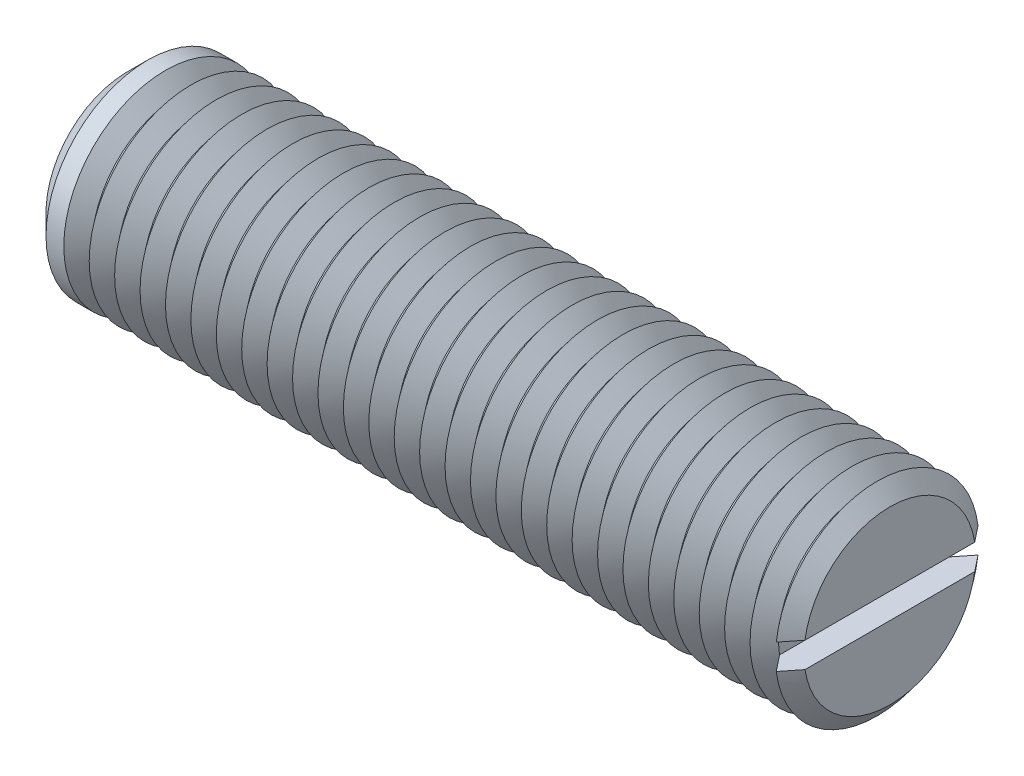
ISO-10303-21;
HEADER;
FILE_DESCRIPTION(('STEP AP214'),'2;1');
FILE_NAME('part.step','',(''),(''),'','','');
FILE_SCHEMA(('AUTOMOTIVE_DESIGN { 1 0 10303 214 1 1 1 1 }'));
ENDSEC;
DATA;
#1=APPLICATION_CONTEXT('core data for automotive mechanical design processes');
#2=APPLICATION_PROTOCOL_DEFINITION('international standard','automotive_design',2000,#1);
#3=PRODUCT_CONTEXT('',#1,'mechanical');
#4=PRODUCT('Part','Part','',(#3));
#5=PRODUCT_RELATED_PRODUCT_CATEGORY('part','',(#4));
#6=PRODUCT_DEFINITION_FORMATION('','',#4);
#7=PRODUCT_DEFINITION_CONTEXT('part definition',#1,'design');
#8=PRODUCT_DEFINITION('design','',#6,#7);
#9=PRODUCT_DEFINITION_SHAPE('','',#8);
#10=(LENGTH_UNIT() NAMED_UNIT(*) SI_UNIT(.MILLI.,.METRE.));
#11=(NAMED_UNIT(*) PLANE_ANGLE_UNIT() SI_UNIT($,.RADIAN.));
#12=(NAMED_UNIT(*) SI_UNIT($,.STERADIAN.) SOLID_ANGLE_UNIT());
#13=UNCERTAINTY_MEASURE_WITH_UNIT(LENGTH_MEASURE(1.E-05),#10,'distance_accuracy_value','');
#14=(GEOMETRIC_REPRESENTATION_CONTEXT(3) GLOBAL_UNCERTAINTY_ASSIGNED_CONTEXT((#13)) GLOBAL_UNIT_ASSIGNED_CONTEXT((#10,
#11,#12)) REPRESENTATION_CONTEXT('',''));
#15=CARTESIAN_POINT('',(0.,0.,0.));
#16=DIRECTION('',(0.,0.,1.));
#17=DIRECTION('',(1.,0.,0.));
#18=AXIS2_PLACEMENT_3D('',#15,#16,#17);
#19=CARTESIAN_POINT('',(29.,0.,0.));
#20=DIRECTION('',(1.,0.,0.));
#21=DIRECTION('',(0.,0.,-1.));
#22=AXIS2_PLACEMENT_3D('',#19,#20,#21);
#23=CONICAL_SURFACE('',#22,8.,0.895664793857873);
#24=CARTESIAN_POINT('',(29.,0.,0.));
#25=DIRECTION('',(-1.,0.,0.));
#26=DIRECTION('',(0.,0.,1.));
#27=AXIS2_PLACEMENT_3D('',#24,#25,#26);
#28=CIRCLE('',#27,8.);
#29=CARTESIAN_POINT('',(29.,-1.,-7.93725393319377));
#30=VERTEX_POINT('',#29);
#31=CARTESIAN_POINT('',(29.,-1.,7.93725393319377));
#32=VERTEX_POINT('',#31);
#33=EDGE_CURVE('E117',#30,#32,#28,.T.);
#34=ORIENTED_EDGE('',*,*,#33,.T.);
#35=CARTESIAN_POINT('',(36.6137872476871,-1.,-17.4810381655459));
#36=CARTESIAN_POINT('',(36.0731000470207,-1.,-16.8046018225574));
#37=CARTESIAN_POINT('',(35.5324624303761,-1.,-16.1281258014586));
#38=CARTESIAN_POINT('',(34.4513425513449,-1.,-14.7749910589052));
#39=CARTESIAN_POINT('',(33.9108602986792,-1.,-14.0983323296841));
#40=CARTESIAN_POINT('',(32.8295593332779,-1.,-12.7440423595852));
#41=CARTESIAN_POINT('',(32.2887409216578,-1.,-12.0664108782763));
#42=CARTESIAN_POINT('',(31.2075665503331,-1.,-10.7108366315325));
#43=CARTESIAN_POINT('',(30.6672105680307,-1.,-10.0328938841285));
#44=CARTESIAN_POINT('',(29.8866021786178,-1.,-9.05235403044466));
#45=CARTESIAN_POINT('',(29.6460332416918,-1.,-8.7500089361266));
#46=CARTESIAN_POINT('',(29.1651110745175,-1.,-8.14514467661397));
#47=CARTESIAN_POINT('',(28.9247578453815,-1.,-7.84262551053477));
#48=CARTESIAN_POINT('',(28.4443170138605,-1.,-7.23730074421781));
#49=CARTESIAN_POINT('',(28.2042294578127,-1.,-6.93449510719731));
#50=CARTESIAN_POINT('',(27.7244992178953,-1.,-6.3285404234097));
#51=CARTESIAN_POINT('',(27.4848565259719,-1.,-6.02539138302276));
#52=CARTESIAN_POINT('',(27.0064209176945,-1.,-5.41876829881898));
#53=CARTESIAN_POINT('',(26.7676275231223,-1.,-5.1152946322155));
#54=CARTESIAN_POINT('',(26.291132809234,-1.,-4.50745556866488));
#55=CARTESIAN_POINT('',(26.0534315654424,-1.,-4.20309011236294));
#56=CARTESIAN_POINT('',(25.6984723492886,-1.,-3.74537358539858));
#57=CARTESIAN_POINT('',(25.580434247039,-1.,-3.59262786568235));
#58=CARTESIAN_POINT('',(25.3451171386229,-1.,-3.28655323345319));
#59=CARTESIAN_POINT('',(25.2278381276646,-1.,-3.13322432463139));
#60=CARTESIAN_POINT('',(24.9944317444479,-1.,-2.82571819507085));
#61=CARTESIAN_POINT('',(24.8783042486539,-1.,-2.67154106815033));
#62=CARTESIAN_POINT('',(24.6478553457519,-1.,-2.36184450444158));
#63=CARTESIAN_POINT('',(24.5335338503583,-1.,-2.20632513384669));
#64=CARTESIAN_POINT('',(24.3956998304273,-1.,-2.01476175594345));
#65=CARTESIAN_POINT('',(24.3706709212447,-1.,-1.97980928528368));
#66=CARTESIAN_POINT('',(24.3208007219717,-1.,-1.90977040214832));
#67=CARTESIAN_POINT('',(24.2959594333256,-1.,-1.87468398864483));
#68=CARTESIAN_POINT('',(24.2217527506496,-1.,-1.76919140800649));
#69=CARTESIAN_POINT('',(24.1727089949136,-1.,-1.69855807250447));
#70=CARTESIAN_POINT('',(24.0751159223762,-1.,-1.55549554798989));
#71=CARTESIAN_POINT('',(24.0265831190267,-1.,-1.48305505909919));
#72=CARTESIAN_POINT('',(23.9312399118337,-1.,-1.33706835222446));
#73=CARTESIAN_POINT('',(23.8844290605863,-1.,-1.2635224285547));
#74=CARTESIAN_POINT('',(23.7926759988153,-1.,-1.11379484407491));
#75=CARTESIAN_POINT('',(23.7477706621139,-1.,-1.03759043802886));
#76=CARTESIAN_POINT('',(23.661907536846,-1.,-0.882780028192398));
#77=CARTESIAN_POINT('',(23.6209558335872,-1.,-0.804170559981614));
#78=CARTESIAN_POINT('',(23.5647846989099,-1.,-0.684500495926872));
#79=CARTESIAN_POINT('',(23.5470539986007,-1.,-0.644631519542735));
#80=CARTESIAN_POINT('',(23.5136729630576,-1.,-0.564036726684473));
#81=CARTESIAN_POINT('',(23.4980230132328,-1.,-0.523310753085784));
#82=CARTESIAN_POINT('',(23.4551526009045,-1.,-0.399956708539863));
#83=CARTESIAN_POINT('',(23.4318433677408,-1.,-0.315816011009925));
#84=CARTESIAN_POINT('',(23.4098657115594,-1.,-0.193542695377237));
#85=CARTESIAN_POINT('',(23.4047261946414,-1.,-0.156548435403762));
#86=CARTESIAN_POINT('',(23.3976757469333,-1.,-0.0822397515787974));
#87=CARTESIAN_POINT('',(23.3957650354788,-1.,-0.0449253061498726));
#88=CARTESIAN_POINT('',(23.3953106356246,-1.,0.0296935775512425));
#89=CARTESIAN_POINT('',(23.3967642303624,-1.,0.0669979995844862));
#90=CARTESIAN_POINT('',(23.402929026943,-1.,0.141334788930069));
#91=CARTESIAN_POINT('',(23.4076406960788,-1.,0.178367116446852));
#92=CARTESIAN_POINT('',(23.4224195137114,-1.,0.266117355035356));
#93=CARTESIAN_POINT('',(23.4338513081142,-1.,0.316604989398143));
#94=CARTESIAN_POINT('',(23.4613106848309,-1.,0.41630917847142));
#95=CARTESIAN_POINT('',(23.4773414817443,-1.,0.465524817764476));
#96=CARTESIAN_POINT('',(23.5130409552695,-1.,0.563049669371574));
#97=CARTESIAN_POINT('',(23.5327381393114,-1.,0.611348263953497));
#98=CARTESIAN_POINT('',(23.5747706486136,-1.,0.706748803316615));
#99=CARTESIAN_POINT('',(23.5971051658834,-1.,0.75385110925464));
#100=CARTESIAN_POINT('',(23.6464135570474,-1.,0.852405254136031));
#101=CARTESIAN_POINT('',(23.6736257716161,-1.,0.903736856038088));
#102=CARTESIAN_POINT('',(23.7298407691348,-1.,1.00541472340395));
#103=CARTESIAN_POINT('',(23.7588439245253,-1.,1.05576078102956));
#104=CARTESIAN_POINT('',(23.8478642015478,-1.,1.20570300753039));
#105=CARTESIAN_POINT('',(23.909851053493,-1.,1.30412495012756));
#106=CARTESIAN_POINT('',(24.037021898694,-1.,1.49921478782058));
#107=CARTESIAN_POINT('',(24.1022138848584,-1.,1.59587737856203));
#108=CARTESIAN_POINT('',(24.2345096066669,-1.,1.787817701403));
#109=CARTESIAN_POINT('',(24.3016124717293,-1.,1.88309603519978));
#110=CARTESIAN_POINT('',(24.4371969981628,-1.,2.07285006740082));
#111=CARTESIAN_POINT('',(24.5056803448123,-1.,2.16732455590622));
#112=CARTESIAN_POINT('',(24.6435598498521,-1.,2.35561985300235));
#113=CARTESIAN_POINT('',(24.7129561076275,-1.,2.44944058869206));
#114=CARTESIAN_POINT('',(24.8522867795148,-1.,2.63643541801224));
#115=CARTESIAN_POINT('',(24.9222200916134,-1.,2.72961033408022));
#116=CARTESIAN_POINT('',(25.0625737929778,-1.,2.91558674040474));
#117=CARTESIAN_POINT('',(25.1329941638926,-1.,3.00838824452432));
#118=CARTESIAN_POINT('',(25.3434401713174,-1.,3.28457080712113));
#119=CARTESIAN_POINT('',(25.4840068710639,-1.,3.46753938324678));
#120=CARTESIAN_POINT('',(25.7660473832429,-1.,3.83277652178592));
#121=CARTESIAN_POINT('',(25.9075212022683,-1.,4.01504507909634));
#122=CARTESIAN_POINT('',(26.332844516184,-1.,4.56116633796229));
#123=CARTESIAN_POINT('',(26.6175870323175,-1.,4.92432312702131));
#124=CARTESIAN_POINT('',(27.1884502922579,-1.,5.64994266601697));
#125=CARTESIAN_POINT('',(27.474571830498,-1.,6.01240478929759));
#126=CARTESIAN_POINT('',(28.0475166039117,-1.,6.73676512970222));
#127=CARTESIAN_POINT('',(28.3343398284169,-1.,7.09866335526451));
#128=CARTESIAN_POINT('',(28.9076446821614,-1.,7.82112227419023));
#129=CARTESIAN_POINT('',(29.1941251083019,-1.,8.18168392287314));
#130=CARTESIAN_POINT('',(29.7673842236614,-1.,8.90257236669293));
#131=CARTESIAN_POINT('',(30.0541629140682,-1.,9.26289916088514));
#132=CARTESIAN_POINT('',(30.9146958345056,-1.,10.3434977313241));
#133=CARTESIAN_POINT('',(31.4887564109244,-1.,11.0635255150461));
#134=CARTESIAN_POINT('',(32.4416309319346,-1.,12.2579358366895));
#135=CARTESIAN_POINT('',(32.8203198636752,-1.,12.7324181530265));
#136=CARTESIAN_POINT('',(33.5778600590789,-1.,13.6812951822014));
#137=CARTESIAN_POINT('',(33.9567113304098,-1.,14.1556898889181));
#138=CARTESIAN_POINT('',(34.7152320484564,-1.,15.105292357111));
#139=CARTESIAN_POINT('',(35.0949016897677,-1.,15.580499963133));
#140=CARTESIAN_POINT('',(35.8543004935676,-1.,16.5308253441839));
#141=CARTESIAN_POINT('',(36.2340296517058,-1.,17.005943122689));
#142=CARTESIAN_POINT('',(36.6137872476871,-1.,17.4810381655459));
#143=B_SPLINE_CURVE_WITH_KNOTS('',3,(#35,#36,#37,#38,#39,#40,#41,#42,#43,#44,#45,#46,#47,#48,
#49,#50,#51,#52,#53,#54,#55,#56,#57,#58,#59,#60,#61,#62,#63,#64,#65,#66,#67,#68,#69,#70,#71,#72,
#73,#74,#75,#76,#77,#78,#79,#80,#81,#82,#83,#84,#85,#86,#87,#88,#89,#90,#91,#92,#93,#94,#95,#96,
#97,#98,#99,#100,#101,#102,#103,#104,#105,#106,#107,#108,#109,#110,#111,#112,#113,#114,#115,
#116,#117,#118,#119,#120,#121,#122,#123,#124,#125,#126,#127,#128,#129,#130,#131,#132,#133,#134,
#135,#136,#137,#138,#139,#140,#141,#142),.UNSPECIFIED.,.F.,.F.,(4,2,2,2,2,2,2,2,2,2,2,2,2,2,2,2,
2,2,2,2,2,2,2,2,2,2,2,2,2,2,2,2,2,2,2,2,2,2,2,2,2,2,2,2,2,2,2,2,2,2,2,2,2,4),(0.,
2.59791825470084,5.19597381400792,7.7969391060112,10.3977690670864,11.5568952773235,
12.7160274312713,13.8753371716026,15.0346257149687,16.1931009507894,17.3516551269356,
17.9307722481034,18.5098857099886,19.0889363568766,19.6679586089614,19.7969273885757,
19.9258971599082,20.1838595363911,20.4454304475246,20.7069329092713,20.9722220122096,
21.2379131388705,21.3687577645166,21.4996265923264,21.7602408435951,21.8721711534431,
21.9841090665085,22.0959566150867,22.2078202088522,22.362827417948,22.5179432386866,
22.6743197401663,22.8306484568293,23.0048946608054,23.1791772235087,23.5280071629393,
23.8777561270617,24.2273482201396,24.5773965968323,24.927483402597,25.276981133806,
25.6264657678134,26.3186514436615,27.0108421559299,28.3952670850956,29.7806179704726,
31.1659479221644,32.5474981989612,33.9290539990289,36.6916375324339,38.5128593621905,
40.3341796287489,42.1589376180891,43.98359654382),.UNSPECIFIED.);
#144=CARTESIAN_POINT('',(28.,-1.,6.67652652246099));
#145=VERTEX_POINT('',#144);
#146=EDGE_CURVE('E109',#145,#32,#143,.T.);
#147=ORIENTED_EDGE('',*,*,#146,.F.);
#148=CARTESIAN_POINT('',(28.,0.,0.));
#149=DIRECTION('',(-1.,0.,0.));
#150=DIRECTION('',(0.,0.,1.));
#151=AXIS2_PLACEMENT_3D('',#148,#149,#150);
#152=CIRCLE('',#151,6.75100040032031);
#153=CARTESIAN_POINT('',(28.,-1.,-6.67652652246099));
#154=VERTEX_POINT('',#153);
#155=EDGE_CURVE('E448',#154,#145,#152,.T.);
#156=ORIENTED_EDGE('',*,*,#155,.F.);
#157=EDGE_CURVE('E58',#30,#154,#143,.T.);
#158=ORIENTED_EDGE('',*,*,#157,.F.);
#159=EDGE_LOOP('',(#34,#147,#156,#158));
#160=FACE_BOUND('',#159,.T.);
#161=ADVANCED_FACE('F37',(#160),#23,.T.);
#162=CARTESIAN_POINT('',(29.,1.,7.93725393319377));
#163=VERTEX_POINT('',#162);
#164=CARTESIAN_POINT('',(29.,1.,-7.93725393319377));
#165=VERTEX_POINT('',#164);
#166=EDGE_CURVE('E100',#163,#165,#28,.T.);
#167=ORIENTED_EDGE('',*,*,#166,.T.);
#168=CARTESIAN_POINT('',(36.6137872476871,1.,17.4810381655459));
#169=CARTESIAN_POINT('',(36.0731000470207,1.,16.8046018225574));
#170=CARTESIAN_POINT('',(35.5324624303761,1.,16.1281258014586));
#171=CARTESIAN_POINT('',(34.4513425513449,1.,14.7749910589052));
#172=CARTESIAN_POINT('',(33.9108602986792,1.,14.0983323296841));
#173=CARTESIAN_POINT('',(32.8295593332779,1.,12.7440423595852));
#174=CARTESIAN_POINT('',(32.2887409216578,1.,12.0664108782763));
#175=CARTESIAN_POINT('',(31.2075665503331,1.,10.7108366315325));
#176=CARTESIAN_POINT('',(30.6672105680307,1.,10.0328938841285));
#177=CARTESIAN_POINT('',(29.8866021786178,1.,9.05235403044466));
#178=CARTESIAN_POINT('',(29.6460332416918,1.,8.7500089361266));
#179=CARTESIAN_POINT('',(29.1651110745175,1.,8.14514467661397));
#180=CARTESIAN_POINT('',(28.9247578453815,1.,7.84262551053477));
#181=CARTESIAN_POINT('',(28.4443170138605,1.,7.23730074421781));
#182=CARTESIAN_POINT('',(28.2042294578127,1.,6.93449510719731));
#183=CARTESIAN_POINT('',(27.7244992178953,1.,6.3285404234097));
#184=CARTESIAN_POINT('',(27.4848565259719,1.,6.02539138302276));
#185=CARTESIAN_POINT('',(27.0064209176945,1.,5.41876829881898));
#186=CARTESIAN_POINT('',(26.7676275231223,1.,5.1152946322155));
#187=CARTESIAN_POINT('',(26.291132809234,1.,4.50745556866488));
#188=CARTESIAN_POINT('',(26.0534315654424,1.,4.20309011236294));
#189=CARTESIAN_POINT('',(25.6984723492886,1.,3.74537358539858));
#190=CARTESIAN_POINT('',(25.580434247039,1.,3.59262786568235));
#191=CARTESIAN_POINT('',(25.3451171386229,1.,3.28655323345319));
#192=CARTESIAN_POINT('',(25.2278381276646,1.,3.13322432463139));
#193=CARTESIAN_POINT('',(24.9944317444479,1.,2.82571819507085));
#194=CARTESIAN_POINT('',(24.8783042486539,1.,2.67154106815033));
#195=CARTESIAN_POINT('',(24.6478553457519,1.,2.36184450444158));
#196=CARTESIAN_POINT('',(24.5335338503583,1.,2.20632513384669));
#197=CARTESIAN_POINT('',(24.3956998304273,1.,2.01476175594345));
#198=CARTESIAN_POINT('',(24.3706709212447,1.,1.97980928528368));
#199=CARTESIAN_POINT('',(24.3208007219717,1.,1.90977040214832));
#200=CARTESIAN_POINT('',(24.2959594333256,1.,1.87468398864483));
#201=CARTESIAN_POINT('',(24.2217527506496,1.,1.76919140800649));
#202=CARTESIAN_POINT('',(24.1727089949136,1.,1.69855807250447));
#203=CARTESIAN_POINT('',(24.0751159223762,1.,1.55549554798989));
#204=CARTESIAN_POINT('',(24.0265831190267,1.,1.48305505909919));
#205=CARTESIAN_POINT('',(23.9312399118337,1.,1.33706835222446));
#206=CARTESIAN_POINT('',(23.8844290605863,1.,1.2635224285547));
#207=CARTESIAN_POINT('',(23.7926759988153,1.,1.11379484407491));
#208=CARTESIAN_POINT('',(23.7477706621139,1.,1.03759043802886));
#209=CARTESIAN_POINT('',(23.661907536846,1.,0.882780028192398));
#210=CARTESIAN_POINT('',(23.6209558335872,1.,0.804170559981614));
#211=CARTESIAN_POINT('',(23.5647846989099,1.,0.684500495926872));
#212=CARTESIAN_POINT('',(23.5470539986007,1.,0.644631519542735));
#213=CARTESIAN_POINT('',(23.5136729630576,1.,0.564036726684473));
#214=CARTESIAN_POINT('',(23.4980230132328,1.,0.523310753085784));
#215=CARTESIAN_POINT('',(23.4551526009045,1.,0.399956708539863));
#216=CARTESIAN_POINT('',(23.4318433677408,1.,0.315816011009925));
#217=CARTESIAN_POINT('',(23.4098657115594,1.,0.193542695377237));
#218=CARTESIAN_POINT('',(23.4047261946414,1.,0.156548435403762));
#219=CARTESIAN_POINT('',(23.3976757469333,1.,0.0822397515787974));
#220=CARTESIAN_POINT('',(23.3957650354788,1.,0.0449253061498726));
#221=CARTESIAN_POINT('',(23.3953106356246,1.,-0.0296935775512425));
#222=CARTESIAN_POINT('',(23.3967642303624,1.,-0.0669979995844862));
#223=CARTESIAN_POINT('',(23.402929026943,1.,-0.141334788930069));
#224=CARTESIAN_POINT('',(23.4076406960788,1.,-0.178367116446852));
#225=CARTESIAN_POINT('',(23.4224195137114,1.,-0.266117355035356));
#226=CARTESIAN_POINT('',(23.4338513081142,1.,-0.316604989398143));
#227=CARTESIAN_POINT('',(23.4613106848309,1.,-0.41630917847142));
#228=CARTESIAN_POINT('',(23.4773414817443,1.,-0.465524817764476));
#229=CARTESIAN_POINT('',(23.5130409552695,1.,-0.563049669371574));
#230=CARTESIAN_POINT('',(23.5327381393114,1.,-0.611348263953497));
#231=CARTESIAN_POINT('',(23.5747706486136,1.,-0.706748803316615));
#232=CARTESIAN_POINT('',(23.5971051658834,1.,-0.75385110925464));
#233=CARTESIAN_POINT('',(23.6464135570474,1.,-0.852405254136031));
#234=CARTESIAN_POINT('',(23.6736257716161,1.,-0.903736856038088));
#235=CARTESIAN_POINT('',(23.7298407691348,1.,-1.00541472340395));
#236=CARTESIAN_POINT('',(23.7588439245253,1.,-1.05576078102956));
#237=CARTESIAN_POINT('',(23.8478642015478,1.,-1.20570300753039));
#238=CARTESIAN_POINT('',(23.909851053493,1.,-1.30412495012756));
#239=CARTESIAN_POINT('',(24.037021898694,1.,-1.49921478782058));
#240=CARTESIAN_POINT('',(24.1022138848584,1.,-1.59587737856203));
#241=CARTESIAN_POINT('',(24.2345096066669,1.,-1.787817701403));
#242=CARTESIAN_POINT('',(24.3016124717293,1.,-1.88309603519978));
#243=CARTESIAN_POINT('',(24.4371969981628,1.,-2.07285006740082));
#244=CARTESIAN_POINT('',(24.5056803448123,1.,-2.16732455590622));
#245=CARTESIAN_POINT('',(24.6435598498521,1.,-2.35561985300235));
#246=CARTESIAN_POINT('',(24.7129561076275,1.,-2.44944058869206));
#247=CARTESIAN_POINT('',(24.8522867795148,1.,-2.63643541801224));
#248=CARTESIAN_POINT('',(24.9222200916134,1.,-2.72961033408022));
#249=CARTESIAN_POINT('',(25.0625737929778,1.,-2.91558674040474));
#250=CARTESIAN_POINT('',(25.1329941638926,1.,-3.00838824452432));
#251=CARTESIAN_POINT('',(25.3434401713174,1.,-3.28457080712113));
#252=CARTESIAN_POINT('',(25.4840068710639,1.,-3.46753938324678));
#253=CARTESIAN_POINT('',(25.7660473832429,1.,-3.83277652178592));
#254=CARTESIAN_POINT('',(25.9075212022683,1.,-4.01504507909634));
#255=CARTESIAN_POINT('',(26.332844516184,1.,-4.56116633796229));
#256=CARTESIAN_POINT('',(26.6175870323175,1.,-4.92432312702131));
#257=CARTESIAN_POINT('',(27.1884502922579,1.,-5.64994266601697));
#258=CARTESIAN_POINT('',(27.474571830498,1.,-6.01240478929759));
#259=CARTESIAN_POINT('',(28.0475166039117,1.,-6.73676512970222));
#260=CARTESIAN_POINT('',(28.3343398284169,1.,-7.09866335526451));
#261=CARTESIAN_POINT('',(28.9076446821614,1.,-7.82112227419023));
#262=CARTESIAN_POINT('',(29.1941251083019,1.,-8.18168392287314));
#263=CARTESIAN_POINT('',(29.7673842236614,1.,-8.90257236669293));
#264=CARTESIAN_POINT('',(30.0541629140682,1.,-9.26289916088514));
#265=CARTESIAN_POINT('',(30.9146958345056,1.,-10.3434977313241));
#266=CARTESIAN_POINT('',(31.4887564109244,1.,-11.0635255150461));
#267=CARTESIAN_POINT('',(32.4416309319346,1.,-12.2579358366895));
#268=CARTESIAN_POINT('',(32.8203198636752,1.,-12.7324181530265));
#269=CARTESIAN_POINT('',(33.5778600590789,1.,-13.6812951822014));
#270=CARTESIAN_POINT('',(33.9567113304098,1.,-14.1556898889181));
#271=CARTESIAN_POINT('',(34.7152320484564,1.,-15.105292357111));
#272=CARTESIAN_POINT('',(35.0949016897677,1.,-15.580499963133));
#273=CARTESIAN_POINT('',(35.8543004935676,1.,-16.5308253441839));
#274=CARTESIAN_POINT('',(36.2340296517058,1.,-17.005943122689));
#275=CARTESIAN_POINT('',(36.6137872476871,1.,-17.4810381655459));
#276=B_SPLINE_CURVE_WITH_KNOTS('',3,(#168,#169,#170,#171,#172,#173,#174,#175,#176,#177,#178,
#179,#180,#181,#182,#183,#184,#185,#186,#187,#188,#189,#190,#191,#192,#193,#194,#195,#196,#197,
#198,#199,#200,#201,#202,#203,#204,#205,#206,#207,#208,#209,#210,#211,#212,#213,#214,#215,#216,
#217,#218,#219,#220,#221,#222,#223,#224,#225,#226,#227,#228,#229,#230,#231,#232,#233,#234,#235,
#236,#237,#238,#239,#240,#241,#242,#243,#244,#245,#246,#247,#248,#249,#250,#251,#252,#253,#254,
#255,#256,#257,#258,#259,#260,#261,#262,#263,#264,#265,#266,#267,#268,#269,#270,#271,#272,#273,
#274,#275),.UNSPECIFIED.,.F.,.F.,(4,2,2,2,2,2,2,2,2,2,2,2,2,2,2,2,2,2,2,2,2,2,2,2,2,2,2,2,2,2,2,
2,2,2,2,2,2,2,2,2,2,2,2,2,2,2,2,2,2,2,2,2,2,4),(0.,2.59791825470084,5.19597381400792,
7.7969391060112,10.3977690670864,11.5568952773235,12.7160274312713,13.8753371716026,
15.0346257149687,16.1931009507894,17.3516551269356,17.9307722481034,18.5098857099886,
19.0889363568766,19.6679586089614,19.7969273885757,19.9258971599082,20.1838595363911,
20.4454304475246,20.7069329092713,20.9722220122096,21.2379131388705,21.3687577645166,
21.4996265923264,21.7602408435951,21.8721711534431,21.9841090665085,22.0959566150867,
22.2078202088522,22.362827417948,22.5179432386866,22.6743197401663,22.8306484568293,
23.0048946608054,23.1791772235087,23.5280071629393,23.8777561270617,24.2273482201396,
24.5773965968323,24.927483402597,25.276981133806,25.6264657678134,26.3186514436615,
27.0108421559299,28.3952670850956,29.7806179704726,31.1659479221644,32.5474981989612,
33.9290539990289,36.6916375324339,38.5128593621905,40.3341796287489,42.1589376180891,
43.98359654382),.UNSPECIFIED.);
#277=CARTESIAN_POINT('',(28.,1.,-6.67652652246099));
#278=VERTEX_POINT('',#277);
#279=EDGE_CURVE('E110',#278,#165,#276,.T.);
#280=ORIENTED_EDGE('',*,*,#279,.F.);
#281=CARTESIAN_POINT('',(28.,1.,6.67652652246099));
#282=VERTEX_POINT('',#281);
#283=EDGE_CURVE('E103',#282,#278,#152,.T.);
#284=ORIENTED_EDGE('',*,*,#283,.F.);
#285=EDGE_CURVE('E97',#163,#282,#276,.T.);
#286=ORIENTED_EDGE('',*,*,#285,.F.);
#287=EDGE_LOOP('',(#167,#280,#284,#286));
#288=FACE_BOUND('',#287,.T.);
#289=ADVANCED_FACE('F99',(#288),#23,.T.);
#290=CARTESIAN_POINT('',(28.,0.,0.));
#291=DIRECTION('',(-1.,0.,0.));
#292=DIRECTION('',(0.,0.,1.));
#293=AXIS2_PLACEMENT_3D('',#290,#291,#292);
#294=CONICAL_SURFACE('',#293,6.75100040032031,0.895664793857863);
#295=CARTESIAN_POINT('',(27.,0.,0.));
#296=DIRECTION('',(-1.,0.,0.));
#297=DIRECTION('',(0.,0.,1.));
#298=AXIS2_PLACEMENT_3D('',#295,#296,#297);
#299=CIRCLE('',#298,8.);
#300=CARTESIAN_POINT('',(27.,0.,8.));
#301=VERTEX_POINT('',#300);
#302=EDGE_CURVE('E436',#301,#301,#299,.T.);
#303=ORIENTED_EDGE('',*,*,#302,.F.);
#304=EDGE_LOOP('',(#303));
#305=FACE_BOUND('',#304,.T.);
#306=ORIENTED_EDGE('',*,*,#283,.T.);
#307=EDGE_CURVE('E443',#278,#154,#152,.T.);
#308=ORIENTED_EDGE('',*,*,#307,.T.);
#309=ORIENTED_EDGE('',*,*,#155,.T.);
#310=EDGE_CURVE('E442',#145,#282,#152,.T.);
#311=ORIENTED_EDGE('',*,*,#310,.T.);
#312=EDGE_LOOP('',(#306,#308,#309,#311));
#313=FACE_BOUND('',#312,.T.);
#314=ADVANCED_FACE('F167',(#305,#313),#294,.T.);
#315=CARTESIAN_POINT('',(30.,0.,0.));
#316=DIRECTION('',(1.,0.,0.));
#317=DIRECTION('',(0.,0.,-1.));
#318=AXIS2_PLACEMENT_3D('',#315,#316,#317);
#319=PLANE('',#318);
#320=CARTESIAN_POINT('',(30.,0.,0.));
#321=DIRECTION('',(-1.,0.,0.));
#322=DIRECTION('',(0.,0.,1.));
#323=AXIS2_PLACEMENT_3D('',#320,#321,#322);
#324=CIRCLE('',#323,6.75100040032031);
#325=CARTESIAN_POINT('',(30.,1.,6.67652652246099));
#326=VERTEX_POINT('',#325);
#327=CARTESIAN_POINT('',(30.,1.,-6.67652652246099));
#328=VERTEX_POINT('',#327);
#329=EDGE_CURVE('E159',#326,#328,#324,.T.);
#330=ORIENTED_EDGE('',*,*,#329,.F.);
#331=DIRECTION('',(0.,0.,1.));
#332=VECTOR('',#331,1.);
#333=CARTESIAN_POINT('',(30.,1.,0.));
#334=LINE('',#333,#332);
#335=EDGE_CURVE('E122',#328,#326,#334,.T.);
#336=ORIENTED_EDGE('',*,*,#335,.F.);
#337=EDGE_LOOP('',(#330,#336));
#338=FACE_BOUND('',#337,.T.);
#339=ADVANCED_FACE('F171',(#338),#319,.T.);
#340=CARTESIAN_POINT('',(30.,-1.,-6.67652652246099));
#341=VERTEX_POINT('',#340);
#342=CARTESIAN_POINT('',(30.,-1.,6.67652652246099));
#343=VERTEX_POINT('',#342);
#344=EDGE_CURVE('E66',#341,#343,#324,.T.);
#345=ORIENTED_EDGE('',*,*,#344,.F.);
#346=DIRECTION('',(0.,0.,-1.));
#347=VECTOR('',#346,1.);
#348=CARTESIAN_POINT('',(30.,-1.,0.));
#349=LINE('',#348,#347);
#350=EDGE_CURVE('E136',#343,#341,#349,.T.);
#351=ORIENTED_EDGE('',*,*,#350,.F.);
#352=EDGE_LOOP('',(#345,#351));
#353=FACE_BOUND('',#352,.T.);
#354=ADVANCED_FACE('F200',(#353),#319,.T.);
#355=CARTESIAN_POINT('',(30.,0.,0.));
#356=DIRECTION('',(-1.,0.,0.));
#357=DIRECTION('',(0.,0.,1.));
#358=AXIS2_PLACEMENT_3D('',#355,#356,#357);
#359=CONICAL_SURFACE('',#358,6.75100040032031,0.895664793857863);
#360=ORIENTED_EDGE('',*,*,#166,.F.);
#361=CARTESIAN_POINT('',(21.3862127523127,1.,-17.4810381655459));
#362=CARTESIAN_POINT('',(21.9268999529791,1.,-16.8046018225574));
#363=CARTESIAN_POINT('',(22.4675375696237,1.,-16.1281258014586));
#364=CARTESIAN_POINT('',(23.5486574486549,1.,-14.7749910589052));
#365=CARTESIAN_POINT('',(24.0891397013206,1.,-14.0983323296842));
#366=CARTESIAN_POINT('',(25.1704406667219,1.,-12.7440423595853));
#367=CARTESIAN_POINT('',(25.711259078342,1.,-12.0664108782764));
#368=CARTESIAN_POINT('',(26.7924334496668,1.,-10.7108366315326));
#369=CARTESIAN_POINT('',(27.3327894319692,1.,-10.0328938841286));
#370=CARTESIAN_POINT('',(28.1133978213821,1.,-9.05235403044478));
#371=CARTESIAN_POINT('',(28.3539667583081,1.,-8.75000893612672));
#372=CARTESIAN_POINT('',(28.8348889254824,1.,-8.14514467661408));
#373=CARTESIAN_POINT('',(29.0752421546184,1.,-7.84262551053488));
#374=CARTESIAN_POINT('',(29.5556829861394,1.,-7.23730074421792));
#375=CARTESIAN_POINT('',(29.7957705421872,1.,-6.93449510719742));
#376=CARTESIAN_POINT('',(30.2755007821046,1.,-6.3285404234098));
#377=CARTESIAN_POINT('',(30.5151434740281,1.,-6.02539138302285));
#378=CARTESIAN_POINT('',(30.9935790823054,1.,-5.41876829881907));
#379=CARTESIAN_POINT('',(31.2323724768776,1.,-5.11529463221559));
#380=CARTESIAN_POINT('',(31.7088671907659,1.,-4.50745556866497));
#381=CARTESIAN_POINT('',(31.9465684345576,1.,-4.20309011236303));
#382=CARTESIAN_POINT('',(32.3015276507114,1.,-3.74537358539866));
#383=CARTESIAN_POINT('',(32.419565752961,1.,-3.59262786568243));
#384=CARTESIAN_POINT('',(32.6548828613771,1.,-3.28655323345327));
#385=CARTESIAN_POINT('',(32.7721618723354,1.,-3.13322432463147));
#386=CARTESIAN_POINT('',(33.0055682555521,1.,-2.82571819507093));
#387=CARTESIAN_POINT('',(33.1216957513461,1.,-2.67154106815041));
#388=CARTESIAN_POINT('',(33.3521446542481,1.,-2.36184450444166));
#389=CARTESIAN_POINT('',(33.4664661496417,1.,-2.20632513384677));
#390=CARTESIAN_POINT('',(33.6043001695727,1.,-2.01476175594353));
#391=CARTESIAN_POINT('',(33.6293290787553,1.,-1.97980928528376));
#392=CARTESIAN_POINT('',(33.6791992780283,1.,-1.90977040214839));
#393=CARTESIAN_POINT('',(33.7040405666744,1.,-1.87468398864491));
#394=CARTESIAN_POINT('',(33.7782472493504,1.,-1.76919140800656));
#395=CARTESIAN_POINT('',(33.8272910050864,1.,-1.69855807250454));
#396=CARTESIAN_POINT('',(33.9248840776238,1.,-1.55549554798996));
#397=CARTESIAN_POINT('',(33.9734168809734,1.,-1.48305505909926));
#398=CARTESIAN_POINT('',(34.0687600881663,1.,-1.33706835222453));
#399=CARTESIAN_POINT('',(34.1155709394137,1.,-1.26352242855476));
#400=CARTESIAN_POINT('',(34.2073240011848,1.,-1.11379484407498));
#401=CARTESIAN_POINT('',(34.2522293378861,1.,-1.03759043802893));
#402=CARTESIAN_POINT('',(34.338092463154,1.,-0.882780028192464));
#403=CARTESIAN_POINT('',(34.3790441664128,1.,-0.804170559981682));
#404=CARTESIAN_POINT('',(34.4352153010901,1.,-0.684500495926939));
#405=CARTESIAN_POINT('',(34.4529460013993,1.,-0.6446315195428));
#406=CARTESIAN_POINT('',(34.4863270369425,1.,-0.564036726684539));
#407=CARTESIAN_POINT('',(34.5019769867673,1.,-0.523310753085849));
#408=CARTESIAN_POINT('',(34.5448473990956,1.,-0.399956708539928));
#409=CARTESIAN_POINT('',(34.5681566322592,1.,-0.315816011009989));
#410=CARTESIAN_POINT('',(34.5901342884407,1.,-0.193542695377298));
#411=CARTESIAN_POINT('',(34.5952738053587,1.,-0.156548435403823));
#412=CARTESIAN_POINT('',(34.6023242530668,1.,-0.0822397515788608));
#413=CARTESIAN_POINT('',(34.6042349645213,1.,-0.0449253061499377));
#414=CARTESIAN_POINT('',(34.6046893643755,1.,0.0296935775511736));
#415=CARTESIAN_POINT('',(34.6032357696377,1.,0.0669979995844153));
#416=CARTESIAN_POINT('',(34.5970709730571,1.,0.141334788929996));
#417=CARTESIAN_POINT('',(34.5923593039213,1.,0.178367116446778));
#418=CARTESIAN_POINT('',(34.5775804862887,1.,0.266117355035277));
#419=CARTESIAN_POINT('',(34.5661486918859,1.,0.316604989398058));
#420=CARTESIAN_POINT('',(34.5386893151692,1.,0.416309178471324));
#421=CARTESIAN_POINT('',(34.5226585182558,1.,0.465524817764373));
#422=CARTESIAN_POINT('',(34.4869590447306,1.,0.563049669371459));
#423=CARTESIAN_POINT('',(34.4672618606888,1.,0.611348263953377));
#424=CARTESIAN_POINT('',(34.4252293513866,1.,0.706748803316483));
#425=CARTESIAN_POINT('',(34.4028948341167,1.,0.753851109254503));
#426=CARTESIAN_POINT('',(34.3535864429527,1.,0.852405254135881));
#427=CARTESIAN_POINT('',(34.3263742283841,1.,0.903736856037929));
#428=CARTESIAN_POINT('',(34.2701592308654,1.,1.00541472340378));
#429=CARTESIAN_POINT('',(34.2411560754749,1.,1.05576078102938));
#430=CARTESIAN_POINT('',(34.1521357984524,1.,1.20570300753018));
#431=CARTESIAN_POINT('',(34.0901489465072,1.,1.30412495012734));
#432=CARTESIAN_POINT('',(33.9629781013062,1.,1.49921478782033));
#433=CARTESIAN_POINT('',(33.8977861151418,1.,1.59587737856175));
#434=CARTESIAN_POINT('',(33.7654903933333,1.,1.78781770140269));
#435=CARTESIAN_POINT('',(33.698387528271,1.,1.88309603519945));
#436=CARTESIAN_POINT('',(33.5628030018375,1.,2.07285006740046));
#437=CARTESIAN_POINT('',(33.4943196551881,1.,2.16732455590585));
#438=CARTESIAN_POINT('',(33.3564401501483,1.,2.35561985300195));
#439=CARTESIAN_POINT('',(33.2870438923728,1.,2.44944058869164));
#440=CARTESIAN_POINT('',(33.1477132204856,1.,2.63643541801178));
#441=CARTESIAN_POINT('',(33.077779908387,1.,2.72961033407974));
#442=CARTESIAN_POINT('',(32.9374262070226,1.,2.91558674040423));
#443=CARTESIAN_POINT('',(32.8670058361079,1.,3.0083882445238));
#444=CARTESIAN_POINT('',(32.6565598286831,1.,3.28457080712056));
#445=CARTESIAN_POINT('',(32.5159931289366,1.,3.46753938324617));
#446=CARTESIAN_POINT('',(32.2339526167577,1.,3.83277652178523));
#447=CARTESIAN_POINT('',(32.0924787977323,1.,4.01504507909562));
#448=CARTESIAN_POINT('',(31.6671554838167,1.,4.56116633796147));
#449=CARTESIAN_POINT('',(31.3824129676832,1.,4.92432312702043));
#450=CARTESIAN_POINT('',(30.8115497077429,1.,5.64994266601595));
#451=CARTESIAN_POINT('',(30.5254281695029,1.,6.0124047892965));
#452=CARTESIAN_POINT('',(29.9524833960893,1.,6.736765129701));
#453=CARTESIAN_POINT('',(29.6656601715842,1.,7.09866335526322));
#454=CARTESIAN_POINT('',(29.0923553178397,1.,7.8211222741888));
#455=CARTESIAN_POINT('',(28.8058748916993,1.,8.18168392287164));
#456=CARTESIAN_POINT('',(28.2326157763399,1.,8.9025723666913));
#457=CARTESIAN_POINT('',(27.9458370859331,1.,9.26289916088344));
#458=CARTESIAN_POINT('',(27.0853041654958,1.,10.3434977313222));
#459=CARTESIAN_POINT('',(26.5112435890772,1.,11.0635255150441));
#460=CARTESIAN_POINT('',(25.5583690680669,1.,12.2579358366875));
#461=CARTESIAN_POINT('',(25.1796801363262,1.,12.7324181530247));
#462=CARTESIAN_POINT('',(24.4221399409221,1.,13.6812951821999));
#463=CARTESIAN_POINT('',(24.0432886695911,1.,14.1556898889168));
#464=CARTESIAN_POINT('',(23.2847679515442,1.,15.1052923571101));
#465=CARTESIAN_POINT('',(22.9050983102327,1.,15.5804999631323));
#466=CARTESIAN_POINT('',(22.1456995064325,1.,16.5308253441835));
#467=CARTESIAN_POINT('',(21.7659703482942,1.,17.0059431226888));
#468=CARTESIAN_POINT('',(21.3862127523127,1.,17.4810381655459));
#469=B_SPLINE_CURVE_WITH_KNOTS('',3,(#361,#362,#363,#364,#365,#366,#367,#368,#369,#370,#371,
#372,#373,#374,#375,#376,#377,#378,#379,#380,#381,#382,#383,#384,#385,#386,#387,#388,#389,#390,
#391,#392,#393,#394,#395,#396,#397,#398,#399,#400,#401,#402,#403,#404,#405,#406,#407,#408,#409,
#410,#411,#412,#413,#414,#415,#416,#417,#418,#419,#420,#421,#422,#423,#424,#425,#426,#427,#428,
#429,#430,#431,#432,#433,#434,#435,#436,#437,#438,#439,#440,#441,#442,#443,#444,#445,#446,#447,
#448,#449,#450,#451,#452,#453,#454,#455,#456,#457,#458,#459,#460,#461,#462,#463,#464,#465,#466,
#467,#468),.UNSPECIFIED.,.F.,.F.,(4,2,2,2,2,2,2,2,2,2,2,2,2,2,2,2,2,2,2,2,2,2,2,2,2,2,2,2,2,2,2,
2,2,2,2,2,2,2,2,2,2,2,2,2,2,2,2,2,2,2,2,2,2,4),(0.,2.59791825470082,5.19597381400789,
7.79693910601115,10.3977690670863,11.5568952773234,12.7160274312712,13.8753371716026,
15.0346257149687,16.1931009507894,17.3516551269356,17.9307722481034,18.5098857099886,
19.0889363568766,19.6679586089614,19.7969273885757,19.9258971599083,20.1838595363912,
20.4454304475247,20.7069329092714,20.9722220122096,21.2379131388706,21.3687577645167,
21.4996265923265,21.7602408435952,21.8721711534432,21.9841090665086,22.0959566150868,
22.2078202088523,22.362827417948,22.5179432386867,22.6743197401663,22.8306484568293,
23.0048946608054,23.1791772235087,23.5280071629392,23.8777561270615,24.2273482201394,
24.577396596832,24.9274834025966,25.2769811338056,25.626465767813,26.3186514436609,
27.0108421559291,28.3952670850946,29.7806179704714,31.1659479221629,32.5474981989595,
33.9290539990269,36.6916375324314,38.5128593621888,40.3341796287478,42.1589376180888,
43.9835965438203),.UNSPECIFIED.);
#470=EDGE_CURVE('E41',#326,#163,#469,.T.);
#471=ORIENTED_EDGE('',*,*,#470,.F.);
#472=ORIENTED_EDGE('',*,*,#329,.T.);
#473=EDGE_CURVE('E11',#165,#328,#469,.T.);
#474=ORIENTED_EDGE('',*,*,#473,.F.);
#475=EDGE_LOOP('',(#360,#471,#472,#474));
#476=FACE_BOUND('',#475,.T.);
#477=ADVANCED_FACE('F114',(#476),#359,.T.);
#478=CARTESIAN_POINT('',(30.,1.,-12.));
#479=DIRECTION('',(0.,1.,0.));
#480=DIRECTION('',(0.,0.,1.));
#481=AXIS2_PLACEMENT_3D('',#478,#479,#480);
#482=PLANE('',#481);
#483=ORIENTED_EDGE('',*,*,#470,.T.);
#484=ORIENTED_EDGE('',*,*,#285,.T.);
#485=DIRECTION('',(0.,0.,1.));
#486=VECTOR('',#485,1.);
#487=CARTESIAN_POINT('',(28.,1.,-12.));
#488=LINE('',#487,#486);
#489=EDGE_CURVE('E145',#278,#282,#488,.T.);
#490=ORIENTED_EDGE('',*,*,#489,.F.);
#491=ORIENTED_EDGE('',*,*,#279,.T.);
#492=ORIENTED_EDGE('',*,*,#473,.T.);
#493=ORIENTED_EDGE('',*,*,#335,.T.);
#494=EDGE_LOOP('',(#483,#484,#490,#491,#492,#493));
#495=FACE_BOUND('',#494,.T.);
#496=ADVANCED_FACE('F120',(#495),#482,.F.);
#497=ORIENTED_EDGE('',*,*,#33,.F.);
#498=CARTESIAN_POINT('',(21.3862127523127,-1.,17.4810381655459));
#499=CARTESIAN_POINT('',(21.9268999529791,-1.,16.8046018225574));
#500=CARTESIAN_POINT('',(22.4675375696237,-1.,16.1281258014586));
#501=CARTESIAN_POINT('',(23.5486574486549,-1.,14.7749910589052));
#502=CARTESIAN_POINT('',(24.0891397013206,-1.,14.0983323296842));
#503=CARTESIAN_POINT('',(25.1704406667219,-1.,12.7440423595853));
#504=CARTESIAN_POINT('',(25.711259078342,-1.,12.0664108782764));
#505=CARTESIAN_POINT('',(26.7924334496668,-1.,10.7108366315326));
#506=CARTESIAN_POINT('',(27.3327894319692,-1.,10.0328938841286));
#507=CARTESIAN_POINT('',(28.1133978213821,-1.,9.05235403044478));
#508=CARTESIAN_POINT('',(28.3539667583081,-1.,8.75000893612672));
#509=CARTESIAN_POINT('',(28.8348889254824,-1.,8.14514467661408));
#510=CARTESIAN_POINT('',(29.0752421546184,-1.,7.84262551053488));
#511=CARTESIAN_POINT('',(29.5556829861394,-1.,7.23730074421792));
#512=CARTESIAN_POINT('',(29.7957705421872,-1.,6.93449510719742));
#513=CARTESIAN_POINT('',(30.2755007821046,-1.,6.3285404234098));
#514=CARTESIAN_POINT('',(30.5151434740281,-1.,6.02539138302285));
#515=CARTESIAN_POINT('',(30.9935790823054,-1.,5.41876829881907));
#516=CARTESIAN_POINT('',(31.2323724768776,-1.,5.11529463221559));
#517=CARTESIAN_POINT('',(31.7088671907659,-1.,4.50745556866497));
#518=CARTESIAN_POINT('',(31.9465684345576,-1.,4.20309011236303));
#519=CARTESIAN_POINT('',(32.3015276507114,-1.,3.74537358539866));
#520=CARTESIAN_POINT('',(32.419565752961,-1.,3.59262786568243));
#521=CARTESIAN_POINT('',(32.6548828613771,-1.,3.28655323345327));
#522=CARTESIAN_POINT('',(32.7721618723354,-1.,3.13322432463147));
#523=CARTESIAN_POINT('',(33.0055682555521,-1.,2.82571819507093));
#524=CARTESIAN_POINT('',(33.1216957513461,-1.,2.67154106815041));
#525=CARTESIAN_POINT('',(33.3521446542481,-1.,2.36184450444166));
#526=CARTESIAN_POINT('',(33.4664661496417,-1.,2.20632513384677));
#527=CARTESIAN_POINT('',(33.6043001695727,-1.,2.01476175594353));
#528=CARTESIAN_POINT('',(33.6293290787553,-1.,1.97980928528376));
#529=CARTESIAN_POINT('',(33.6791992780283,-1.,1.90977040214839));
#530=CARTESIAN_POINT('',(33.7040405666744,-1.,1.87468398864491));
#531=CARTESIAN_POINT('',(33.7782472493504,-1.,1.76919140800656));
#532=CARTESIAN_POINT('',(33.8272910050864,-1.,1.69855807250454));
#533=CARTESIAN_POINT('',(33.9248840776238,-1.,1.55549554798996));
#534=CARTESIAN_POINT('',(33.9734168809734,-1.,1.48305505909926));
#535=CARTESIAN_POINT('',(34.0687600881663,-1.,1.33706835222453));
#536=CARTESIAN_POINT('',(34.1155709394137,-1.,1.26352242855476));
#537=CARTESIAN_POINT('',(34.2073240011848,-1.,1.11379484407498));
#538=CARTESIAN_POINT('',(34.2522293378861,-1.,1.03759043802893));
#539=CARTESIAN_POINT('',(34.338092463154,-1.,0.882780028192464));
#540=CARTESIAN_POINT('',(34.3790441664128,-1.,0.804170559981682));
#541=CARTESIAN_POINT('',(34.4352153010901,-1.,0.684500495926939));
#542=CARTESIAN_POINT('',(34.4529460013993,-1.,0.6446315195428));
#543=CARTESIAN_POINT('',(34.4863270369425,-1.,0.564036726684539));
#544=CARTESIAN_POINT('',(34.5019769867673,-1.,0.523310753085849));
#545=CARTESIAN_POINT('',(34.5448473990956,-1.,0.399956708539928));
#546=CARTESIAN_POINT('',(34.5681566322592,-1.,0.315816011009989));
#547=CARTESIAN_POINT('',(34.5901342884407,-1.,0.193542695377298));
#548=CARTESIAN_POINT('',(34.5952738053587,-1.,0.156548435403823));
#549=CARTESIAN_POINT('',(34.6023242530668,-1.,0.0822397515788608));
#550=CARTESIAN_POINT('',(34.6042349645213,-1.,0.0449253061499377));
#551=CARTESIAN_POINT('',(34.6046893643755,-1.,-0.0296935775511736));
#552=CARTESIAN_POINT('',(34.6032357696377,-1.,-0.0669979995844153));
#553=CARTESIAN_POINT('',(34.5970709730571,-1.,-0.141334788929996));
#554=CARTESIAN_POINT('',(34.5923593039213,-1.,-0.178367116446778));
#555=CARTESIAN_POINT('',(34.5775804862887,-1.,-0.266117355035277));
#556=CARTESIAN_POINT('',(34.5661486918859,-1.,-0.316604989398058));
#557=CARTESIAN_POINT('',(34.5386893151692,-1.,-0.416309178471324));
#558=CARTESIAN_POINT('',(34.5226585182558,-1.,-0.465524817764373));
#559=CARTESIAN_POINT('',(34.4869590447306,-1.,-0.563049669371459));
#560=CARTESIAN_POINT('',(34.4672618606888,-1.,-0.611348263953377));
#561=CARTESIAN_POINT('',(34.4252293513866,-1.,-0.706748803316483));
#562=CARTESIAN_POINT('',(34.4028948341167,-1.,-0.753851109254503));
#563=CARTESIAN_POINT('',(34.3535864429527,-1.,-0.852405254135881));
#564=CARTESIAN_POINT('',(34.3263742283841,-1.,-0.903736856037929));
#565=CARTESIAN_POINT('',(34.2701592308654,-1.,-1.00541472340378));
#566=CARTESIAN_POINT('',(34.2411560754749,-1.,-1.05576078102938));
#567=CARTESIAN_POINT('',(34.1521357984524,-1.,-1.20570300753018));
#568=CARTESIAN_POINT('',(34.0901489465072,-1.,-1.30412495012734));
#569=CARTESIAN_POINT('',(33.9629781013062,-1.,-1.49921478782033));
#570=CARTESIAN_POINT('',(33.8977861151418,-1.,-1.59587737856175));
#571=CARTESIAN_POINT('',(33.7654903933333,-1.,-1.78781770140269));
#572=CARTESIAN_POINT('',(33.698387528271,-1.,-1.88309603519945));
#573=CARTESIAN_POINT('',(33.5628030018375,-1.,-2.07285006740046));
#574=CARTESIAN_POINT('',(33.4943196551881,-1.,-2.16732455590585));
#575=CARTESIAN_POINT('',(33.3564401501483,-1.,-2.35561985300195));
#576=CARTESIAN_POINT('',(33.2870438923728,-1.,-2.44944058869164));
#577=CARTESIAN_POINT('',(33.1477132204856,-1.,-2.63643541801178));
#578=CARTESIAN_POINT('',(33.077779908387,-1.,-2.72961033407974));
#579=CARTESIAN_POINT('',(32.9374262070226,-1.,-2.91558674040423));
#580=CARTESIAN_POINT('',(32.8670058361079,-1.,-3.0083882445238));
#581=CARTESIAN_POINT('',(32.6565598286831,-1.,-3.28457080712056));
#582=CARTESIAN_POINT('',(32.5159931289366,-1.,-3.46753938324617));
#583=CARTESIAN_POINT('',(32.2339526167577,-1.,-3.83277652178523));
#584=CARTESIAN_POINT('',(32.0924787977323,-1.,-4.01504507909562));
#585=CARTESIAN_POINT('',(31.6671554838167,-1.,-4.56116633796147));
#586=CARTESIAN_POINT('',(31.3824129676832,-1.,-4.92432312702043));
#587=CARTESIAN_POINT('',(30.8115497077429,-1.,-5.64994266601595));
#588=CARTESIAN_POINT('',(30.5254281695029,-1.,-6.0124047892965));
#589=CARTESIAN_POINT('',(29.9524833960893,-1.,-6.736765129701));
#590=CARTESIAN_POINT('',(29.6656601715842,-1.,-7.09866335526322));
#591=CARTESIAN_POINT('',(29.0923553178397,-1.,-7.8211222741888));
#592=CARTESIAN_POINT('',(28.8058748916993,-1.,-8.18168392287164));
#593=CARTESIAN_POINT('',(28.2326157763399,-1.,-8.9025723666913));
#594=CARTESIAN_POINT('',(27.9458370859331,-1.,-9.26289916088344));
#595=CARTESIAN_POINT('',(27.0853041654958,-1.,-10.3434977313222));
#596=CARTESIAN_POINT('',(26.5112435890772,-1.,-11.0635255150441));
#597=CARTESIAN_POINT('',(25.5583690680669,-1.,-12.2579358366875));
#598=CARTESIAN_POINT('',(25.1796801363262,-1.,-12.7324181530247));
#599=CARTESIAN_POINT('',(24.4221399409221,-1.,-13.6812951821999));
#600=CARTESIAN_POINT('',(24.0432886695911,-1.,-14.1556898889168));
#601=CARTESIAN_POINT('',(23.2847679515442,-1.,-15.1052923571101));
#602=CARTESIAN_POINT('',(22.9050983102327,-1.,-15.5804999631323));
#603=CARTESIAN_POINT('',(22.1456995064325,-1.,-16.5308253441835));
#604=CARTESIAN_POINT('',(21.7659703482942,-1.,-17.0059431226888));
#605=CARTESIAN_POINT('',(21.3862127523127,-1.,-17.4810381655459));
#606=B_SPLINE_CURVE_WITH_KNOTS('',3,(#498,#499,#500,#501,#502,#503,#504,#505,#506,#507,#508,
#509,#510,#511,#512,#513,#514,#515,#516,#517,#518,#519,#520,#521,#522,#523,#524,#525,#526,#527,
#528,#529,#530,#531,#532,#533,#534,#535,#536,#537,#538,#539,#540,#541,#542,#543,#544,#545,#546,
#547,#548,#549,#550,#551,#552,#553,#554,#555,#556,#557,#558,#559,#560,#561,#562,#563,#564,#565,
#566,#567,#568,#569,#570,#571,#572,#573,#574,#575,#576,#577,#578,#579,#580,#581,#582,#583,#584,
#585,#586,#587,#588,#589,#590,#591,#592,#593,#594,#595,#596,#597,#598,#599,#600,#601,#602,#603,
#604,#605),.UNSPECIFIED.,.F.,.F.,(4,2,2,2,2,2,2,2,2,2,2,2,2,2,2,2,2,2,2,2,2,2,2,2,2,2,2,2,2,2,2,
2,2,2,2,2,2,2,2,2,2,2,2,2,2,2,2,2,2,2,2,2,2,4),(0.,2.59791825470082,5.19597381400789,
7.79693910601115,10.3977690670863,11.5568952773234,12.7160274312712,13.8753371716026,
15.0346257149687,16.1931009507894,17.3516551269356,17.9307722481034,18.5098857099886,
19.0889363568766,19.6679586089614,19.7969273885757,19.9258971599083,20.1838595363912,
20.4454304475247,20.7069329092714,20.9722220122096,21.2379131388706,21.3687577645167,
21.4996265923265,21.7602408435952,21.8721711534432,21.9841090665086,22.0959566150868,
22.2078202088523,22.362827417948,22.5179432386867,22.6743197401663,22.8306484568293,
23.0048946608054,23.1791772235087,23.5280071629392,23.8777561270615,24.2273482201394,
24.577396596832,24.9274834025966,25.2769811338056,25.626465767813,26.3186514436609,
27.0108421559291,28.3952670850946,29.7806179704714,31.1659479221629,32.5474981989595,
33.9290539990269,36.6916375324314,38.5128593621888,40.3341796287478,42.1589376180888,
43.9835965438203),.UNSPECIFIED.);
#607=EDGE_CURVE('E151',#341,#30,#606,.T.);
#608=ORIENTED_EDGE('',*,*,#607,.F.);
#609=ORIENTED_EDGE('',*,*,#344,.T.);
#610=EDGE_CURVE('E147',#32,#343,#606,.T.);
#611=ORIENTED_EDGE('',*,*,#610,.F.);
#612=EDGE_LOOP('',(#497,#608,#609,#611));
#613=FACE_BOUND('',#612,.T.);
#614=ADVANCED_FACE('F163',(#613),#359,.T.);
#615=CARTESIAN_POINT('',(30.,-1.,-12.));
#616=DIRECTION('',(0.,-1.,0.));
#617=DIRECTION('',(0.,0.,-1.));
#618=AXIS2_PLACEMENT_3D('',#615,#616,#617);
#619=PLANE('',#618);
#620=ORIENTED_EDGE('',*,*,#607,.T.);
#621=ORIENTED_EDGE('',*,*,#157,.T.);
#622=DIRECTION('',(0.,0.,1.));
#623=VECTOR('',#622,1.);
#624=CARTESIAN_POINT('',(28.,-1.,-12.));
#625=LINE('',#624,#623);
#626=EDGE_CURVE('E144',#154,#145,#625,.T.);
#627=ORIENTED_EDGE('',*,*,#626,.T.);
#628=ORIENTED_EDGE('',*,*,#146,.T.);
#629=ORIENTED_EDGE('',*,*,#610,.T.);
#630=ORIENTED_EDGE('',*,*,#350,.T.);
#631=EDGE_LOOP('',(#620,#621,#627,#628,#629,#630));
#632=FACE_BOUND('',#631,.T.);
#633=ADVANCED_FACE('F160',(#632),#619,.F.);
#634=CARTESIAN_POINT('',(28.,1.,-12.));
#635=DIRECTION('',(-1.,0.,0.));
#636=DIRECTION('',(0.,0.,1.));
#637=AXIS2_PLACEMENT_3D('',#634,#635,#636);
#638=PLANE('',#637);
#639=ORIENTED_EDGE('',*,*,#626,.F.);
#640=ORIENTED_EDGE('',*,*,#307,.F.);
#641=ORIENTED_EDGE('',*,*,#489,.T.);
#642=ORIENTED_EDGE('',*,*,#310,.F.);
#643=EDGE_LOOP('',(#639,#640,#641,#642));
#644=FACE_BOUND('',#643,.T.);
#645=ADVANCED_FACE('F452',(#644),#638,.F.);
#646=CARTESIAN_POINT('',(26.,0.,0.));
#647=DIRECTION('',(-1.,0.,0.));
#648=DIRECTION('',(0.,0.,1.));
#649=AXIS2_PLACEMENT_3D('',#646,#647,#648);
#650=CONICAL_SURFACE('',#649,6.75100040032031,0.895664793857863);
#651=CARTESIAN_POINT('',(25.,0.,0.));
#652=DIRECTION('',(-1.,0.,0.));
#653=DIRECTION('',(0.,0.,1.));
#654=AXIS2_PLACEMENT_3D('',#651,#652,#653);
#655=CIRCLE('',#654,8.);
#656=CARTESIAN_POINT('',(25.,0.,8.));
#657=VERTEX_POINT('',#656);
#658=EDGE_CURVE('E428',#657,#657,#655,.T.);
#659=ORIENTED_EDGE('',*,*,#658,.F.);
#660=EDGE_LOOP('',(#659));
#661=FACE_BOUND('',#660,.T.);
#662=CARTESIAN_POINT('',(26.,0.,0.));
#663=DIRECTION('',(-1.,0.,0.));
#664=DIRECTION('',(0.,0.,1.));
#665=AXIS2_PLACEMENT_3D('',#662,#663,#664);
#666=CIRCLE('',#665,6.75100040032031);
#667=CARTESIAN_POINT('',(26.,0.,6.75100040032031));
#668=VERTEX_POINT('',#667);
#669=EDGE_CURVE('E440',#668,#668,#666,.T.);
#670=ORIENTED_EDGE('',*,*,#669,.T.);
#671=EDGE_LOOP('',(#670));
#672=FACE_BOUND('',#671,.T.);
#673=ADVANCED_FACE('F176',(#661,#672),#650,.T.);
#674=CARTESIAN_POINT('',(27.,0.,0.));
#675=DIRECTION('',(1.,0.,0.));
#676=DIRECTION('',(0.,0.,-1.));
#677=AXIS2_PLACEMENT_3D('',#674,#675,#676);
#678=CONICAL_SURFACE('',#677,8.,0.895664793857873);
#679=ORIENTED_EDGE('',*,*,#669,.F.);
#680=EDGE_LOOP('',(#679));
#681=FACE_BOUND('',#680,.T.);
#682=ORIENTED_EDGE('',*,*,#302,.T.);
#683=EDGE_LOOP('',(#682));
#684=FACE_BOUND('',#683,.T.);
#685=ADVANCED_FACE('F458',(#681,#684),#678,.T.);
#686=CARTESIAN_POINT('',(24.,0.,0.));
#687=DIRECTION('',(-1.,0.,0.));
#688=DIRECTION('',(0.,0.,1.));
#689=AXIS2_PLACEMENT_3D('',#686,#687,#688);
#690=CONICAL_SURFACE('',#689,6.75100040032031,0.895664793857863);
#691=CARTESIAN_POINT('',(23.,0.,0.));
#692=DIRECTION('',(-1.,0.,0.));
#693=DIRECTION('',(0.,0.,1.));
#694=AXIS2_PLACEMENT_3D('',#691,#692,#693);
#695=CIRCLE('',#694,8.);
#696=CARTESIAN_POINT('',(23.,0.,8.));
#697=VERTEX_POINT('',#696);
#698=EDGE_CURVE('E420',#697,#697,#695,.T.);
#699=ORIENTED_EDGE('',*,*,#698,.F.);
#700=EDGE_LOOP('',(#699));
#701=FACE_BOUND('',#700,.T.);
#702=CARTESIAN_POINT('',(24.,0.,0.));
#703=DIRECTION('',(-1.,0.,0.));
#704=DIRECTION('',(0.,0.,1.));
#705=AXIS2_PLACEMENT_3D('',#702,#703,#704);
#706=CIRCLE('',#705,6.75100040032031);
#707=CARTESIAN_POINT('',(24.,0.,6.75100040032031));
#708=VERTEX_POINT('',#707);
#709=EDGE_CURVE('E432',#708,#708,#706,.T.);
#710=ORIENTED_EDGE('',*,*,#709,.T.);
#711=EDGE_LOOP('',(#710));
#712=FACE_BOUND('',#711,.T.);
#713=ADVANCED_FACE('F522',(#701,#712),#690,.T.);
#714=CARTESIAN_POINT('',(25.,0.,0.));
#715=DIRECTION('',(1.,0.,0.));
#716=DIRECTION('',(0.,0.,-1.));
#717=AXIS2_PLACEMENT_3D('',#714,#715,#716);
#718=CONICAL_SURFACE('',#717,8.,0.895664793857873);
#719=ORIENTED_EDGE('',*,*,#709,.F.);
#720=EDGE_LOOP('',(#719));
#721=FACE_BOUND('',#720,.T.);
#722=ORIENTED_EDGE('',*,*,#658,.T.);
#723=EDGE_LOOP('',(#722));
#724=FACE_BOUND('',#723,.T.);
#725=ADVANCED_FACE('F531',(#721,#724),#718,.T.);
#726=CARTESIAN_POINT('',(22.,0.,0.));
#727=DIRECTION('',(-1.,0.,0.));
#728=DIRECTION('',(0.,0.,1.));
#729=AXIS2_PLACEMENT_3D('',#726,#727,#728);
#730=CONICAL_SURFACE('',#729,6.75100040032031,0.895664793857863);
#731=CARTESIAN_POINT('',(21.,0.,0.));
#732=DIRECTION('',(-1.,0.,0.));
#733=DIRECTION('',(0.,0.,1.));
#734=AXIS2_PLACEMENT_3D('',#731,#732,#733);
#735=CIRCLE('',#734,8.);
#736=CARTESIAN_POINT('',(21.,0.,8.));
#737=VERTEX_POINT('',#736);
#738=EDGE_CURVE('E412',#737,#737,#735,.T.);
#739=ORIENTED_EDGE('',*,*,#738,.F.);
#740=EDGE_LOOP('',(#739));
#741=FACE_BOUND('',#740,.T.);
#742=CARTESIAN_POINT('',(22.,0.,0.));
#743=DIRECTION('',(-1.,0.,0.));
#744=DIRECTION('',(0.,0.,1.));
#745=AXIS2_PLACEMENT_3D('',#742,#743,#744);
#746=CIRCLE('',#745,6.75100040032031);
#747=CARTESIAN_POINT('',(22.,0.,6.75100040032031));
#748=VERTEX_POINT('',#747);
#749=EDGE_CURVE('E424',#748,#748,#746,.T.);
#750=ORIENTED_EDGE('',*,*,#749,.T.);
#751=EDGE_LOOP('',(#750));
#752=FACE_BOUND('',#751,.T.);
#753=ADVANCED_FACE('F541',(#741,#752),#730,.T.);
#754=CARTESIAN_POINT('',(23.,0.,0.));
#755=DIRECTION('',(1.,0.,0.));
#756=DIRECTION('',(0.,0.,-1.));
#757=AXIS2_PLACEMENT_3D('',#754,#755,#756);
#758=CONICAL_SURFACE('',#757,8.,0.895664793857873);
#759=ORIENTED_EDGE('',*,*,#749,.F.);
#760=EDGE_LOOP('',(#759));
#761=FACE_BOUND('',#760,.T.);
#762=ORIENTED_EDGE('',*,*,#698,.T.);
#763=EDGE_LOOP('',(#762));
#764=FACE_BOUND('',#763,.T.);
#765=ADVANCED_FACE('F551',(#761,#764),#758,.T.);
#766=CARTESIAN_POINT('',(20.,0.,0.));
#767=DIRECTION('',(-1.,0.,0.));
#768=DIRECTION('',(0.,0.,1.));
#769=AXIS2_PLACEMENT_3D('',#766,#767,#768);
#770=CONICAL_SURFACE('',#769,6.75100040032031,0.895664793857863);
#771=CARTESIAN_POINT('',(19.,0.,0.));
#772=DIRECTION('',(-1.,0.,0.));
#773=DIRECTION('',(0.,0.,1.));
#774=AXIS2_PLACEMENT_3D('',#771,#772,#773);
#775=CIRCLE('',#774,8.);
#776=CARTESIAN_POINT('',(19.,0.,8.));
#777=VERTEX_POINT('',#776);
#778=EDGE_CURVE('E404',#777,#777,#775,.T.);
#779=ORIENTED_EDGE('',*,*,#778,.F.);
#780=EDGE_LOOP('',(#779));
#781=FACE_BOUND('',#780,.T.);
#782=CARTESIAN_POINT('',(20.,0.,0.));
#783=DIRECTION('',(-1.,0.,0.));
#784=DIRECTION('',(0.,0.,1.));
#785=AXIS2_PLACEMENT_3D('',#782,#783,#784);
#786=CIRCLE('',#785,6.75100040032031);
#787=CARTESIAN_POINT('',(20.,0.,6.75100040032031));
#788=VERTEX_POINT('',#787);
#789=EDGE_CURVE('E416',#788,#788,#786,.T.);
#790=ORIENTED_EDGE('',*,*,#789,.T.);
#791=EDGE_LOOP('',(#790));
#792=FACE_BOUND('',#791,.T.);
#793=ADVANCED_FACE('F561',(#781,#792),#770,.T.);
#794=CARTESIAN_POINT('',(21.,0.,0.));
#795=DIRECTION('',(1.,0.,0.));
#796=DIRECTION('',(0.,0.,-1.));
#797=AXIS2_PLACEMENT_3D('',#794,#795,#796);
#798=CONICAL_SURFACE('',#797,8.,0.895664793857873);
#799=ORIENTED_EDGE('',*,*,#789,.F.);
#800=EDGE_LOOP('',(#799));
#801=FACE_BOUND('',#800,.T.);
#802=ORIENTED_EDGE('',*,*,#738,.T.);
#803=EDGE_LOOP('',(#802));
#804=FACE_BOUND('',#803,.T.);
#805=ADVANCED_FACE('F571',(#801,#804),#798,.T.);
#806=CARTESIAN_POINT('',(18.,0.,0.));
#807=DIRECTION('',(-1.,0.,0.));
#808=DIRECTION('',(0.,0.,1.));
#809=AXIS2_PLACEMENT_3D('',#806,#807,#808);
#810=CONICAL_SURFACE('',#809,6.75100040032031,0.895664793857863);
#811=CARTESIAN_POINT('',(17.,0.,0.));
#812=DIRECTION('',(-1.,0.,0.));
#813=DIRECTION('',(0.,0.,1.));
#814=AXIS2_PLACEMENT_3D('',#811,#812,#813);
#815=CIRCLE('',#814,8.);
#816=CARTESIAN_POINT('',(17.,0.,8.));
#817=VERTEX_POINT('',#816);
#818=EDGE_CURVE('E397',#817,#817,#815,.T.);
#819=ORIENTED_EDGE('',*,*,#818,.F.);
#820=EDGE_LOOP('',(#819));
#821=FACE_BOUND('',#820,.T.);
#822=CARTESIAN_POINT('',(18.,0.,0.));
#823=DIRECTION('',(-1.,0.,0.));
#824=DIRECTION('',(0.,0.,1.));
#825=AXIS2_PLACEMENT_3D('',#822,#823,#824);
#826=CIRCLE('',#825,6.75100040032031);
#827=CARTESIAN_POINT('',(18.,0.,6.75100040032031));
#828=VERTEX_POINT('',#827);
#829=EDGE_CURVE('E408',#828,#828,#826,.T.);
#830=ORIENTED_EDGE('',*,*,#829,.T.);
#831=EDGE_LOOP('',(#830));
#832=FACE_BOUND('',#831,.T.);
#833=ADVANCED_FACE('F581',(#821,#832),#810,.T.);
#834=CARTESIAN_POINT('',(19.,0.,0.));
#835=DIRECTION('',(1.,0.,0.));
#836=DIRECTION('',(0.,0.,-1.));
#837=AXIS2_PLACEMENT_3D('',#834,#835,#836);
#838=CONICAL_SURFACE('',#837,8.,0.895664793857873);
#839=ORIENTED_EDGE('',*,*,#829,.F.);
#840=EDGE_LOOP('',(#839));
#841=FACE_BOUND('',#840,.T.);
#842=ORIENTED_EDGE('',*,*,#778,.T.);
#843=EDGE_LOOP('',(#842));
#844=FACE_BOUND('',#843,.T.);
#845=ADVANCED_FACE('F591',(#841,#844),#838,.T.);
#846=CARTESIAN_POINT('',(16.,0.,0.));
#847=DIRECTION('',(-1.,0.,0.));
#848=DIRECTION('',(0.,0.,1.));
#849=AXIS2_PLACEMENT_3D('',#846,#847,#848);
#850=CONICAL_SURFACE('',#849,6.75100040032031,0.895664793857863);
#851=CARTESIAN_POINT('',(15.,0.,0.));
#852=DIRECTION('',(-1.,0.,0.));
#853=DIRECTION('',(0.,0.,1.));
#854=AXIS2_PLACEMENT_3D('',#851,#852,#853);
#855=CIRCLE('',#854,8.);
#856=CARTESIAN_POINT('',(15.,0.,8.));
#857=VERTEX_POINT('',#856);
#858=EDGE_CURVE('E390',#857,#857,#855,.T.);
#859=ORIENTED_EDGE('',*,*,#858,.F.);
#860=EDGE_LOOP('',(#859));
#861=FACE_BOUND('',#860,.T.);
#862=CARTESIAN_POINT('',(16.,0.,0.));
#863=DIRECTION('',(-1.,0.,0.));
#864=DIRECTION('',(0.,0.,1.));
#865=AXIS2_PLACEMENT_3D('',#862,#863,#864);
#866=CIRCLE('',#865,6.75100040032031);
#867=CARTESIAN_POINT('',(16.,0.,6.75100040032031));
#868=VERTEX_POINT('',#867);
#869=EDGE_CURVE('E400',#868,#868,#866,.T.);
#870=ORIENTED_EDGE('',*,*,#869,.T.);
#871=EDGE_LOOP('',(#870));
#872=FACE_BOUND('',#871,.T.);
#873=ADVANCED_FACE('F601',(#861,#872),#850,.T.);
#874=CARTESIAN_POINT('',(17.,0.,0.));
#875=DIRECTION('',(1.,0.,0.));
#876=DIRECTION('',(0.,0.,-1.));
#877=AXIS2_PLACEMENT_3D('',#874,#875,#876);
#878=CONICAL_SURFACE('',#877,8.,0.895664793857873);
#879=ORIENTED_EDGE('',*,*,#869,.F.);
#880=EDGE_LOOP('',(#879));
#881=FACE_BOUND('',#880,.T.);
#882=ORIENTED_EDGE('',*,*,#818,.T.);
#883=EDGE_LOOP('',(#882));
#884=FACE_BOUND('',#883,.T.);
#885=ADVANCED_FACE('F611',(#881,#884),#878,.T.);
#886=CARTESIAN_POINT('',(14.,0.,0.));
#887=DIRECTION('',(-1.,0.,0.));
#888=DIRECTION('',(0.,0.,1.));
#889=AXIS2_PLACEMENT_3D('',#886,#887,#888);
#890=CONICAL_SURFACE('',#889,6.75100040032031,0.895664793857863);
#891=CARTESIAN_POINT('',(13.,0.,0.));
#892=DIRECTION('',(-1.,0.,0.));
#893=DIRECTION('',(0.,0.,1.));
#894=AXIS2_PLACEMENT_3D('',#891,#892,#893);
#895=CIRCLE('',#894,8.);
#896=CARTESIAN_POINT('',(13.,0.,8.));
#897=VERTEX_POINT('',#896);
#898=EDGE_CURVE('E382',#897,#897,#895,.T.);
#899=ORIENTED_EDGE('',*,*,#898,.F.);
#900=EDGE_LOOP('',(#899));
#901=FACE_BOUND('',#900,.T.);
#902=CARTESIAN_POINT('',(14.,0.,0.));
#903=DIRECTION('',(-1.,0.,0.));
#904=DIRECTION('',(0.,0.,1.));
#905=AXIS2_PLACEMENT_3D('',#902,#903,#904);
#906=CIRCLE('',#905,6.75100040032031);
#907=CARTESIAN_POINT('',(14.,0.,6.75100040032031));
#908=VERTEX_POINT('',#907);
#909=EDGE_CURVE('E393',#908,#908,#906,.T.);
#910=ORIENTED_EDGE('',*,*,#909,.T.);
#911=EDGE_LOOP('',(#910));
#912=FACE_BOUND('',#911,.T.);
#913=ADVANCED_FACE('F621',(#901,#912),#890,.T.);
#914=CARTESIAN_POINT('',(15.,0.,0.));
#915=DIRECTION('',(1.,0.,0.));
#916=DIRECTION('',(0.,0.,-1.));
#917=AXIS2_PLACEMENT_3D('',#914,#915,#916);
#918=CONICAL_SURFACE('',#917,8.,0.895664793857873);
#919=ORIENTED_EDGE('',*,*,#909,.F.);
#920=EDGE_LOOP('',(#919));
#921=FACE_BOUND('',#920,.T.);
#922=ORIENTED_EDGE('',*,*,#858,.T.);
#923=EDGE_LOOP('',(#922));
#924=FACE_BOUND('',#923,.T.);
#925=ADVANCED_FACE('F631',(#921,#924),#918,.T.);
#926=CARTESIAN_POINT('',(12.,0.,0.));
#927=DIRECTION('',(-1.,0.,0.));
#928=DIRECTION('',(0.,0.,1.));
#929=AXIS2_PLACEMENT_3D('',#926,#927,#928);
#930=CONICAL_SURFACE('',#929,6.75100040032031,0.895664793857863);
#931=CARTESIAN_POINT('',(11.,0.,0.));
#932=DIRECTION('',(-1.,0.,0.));
#933=DIRECTION('',(0.,0.,1.));
#934=AXIS2_PLACEMENT_3D('',#931,#932,#933);
#935=CIRCLE('',#934,8.);
#936=CARTESIAN_POINT('',(11.,0.,8.));
#937=VERTEX_POINT('',#936);
#938=EDGE_CURVE('E374',#937,#937,#935,.T.);
#939=ORIENTED_EDGE('',*,*,#938,.F.);
#940=EDGE_LOOP('',(#939));
#941=FACE_BOUND('',#940,.T.);
#942=CARTESIAN_POINT('',(12.,0.,0.));
#943=DIRECTION('',(-1.,0.,0.));
#944=DIRECTION('',(0.,0.,1.));
#945=AXIS2_PLACEMENT_3D('',#942,#943,#944);
#946=CIRCLE('',#945,6.75100040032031);
#947=CARTESIAN_POINT('',(12.,0.,6.75100040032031));
#948=VERTEX_POINT('',#947);
#949=EDGE_CURVE('E386',#948,#948,#946,.T.);
#950=ORIENTED_EDGE('',*,*,#949,.T.);
#951=EDGE_LOOP('',(#950));
#952=FACE_BOUND('',#951,.T.);
#953=ADVANCED_FACE('F641',(#941,#952),#930,.T.);
#954=CARTESIAN_POINT('',(13.,0.,0.));
#955=DIRECTION('',(1.,0.,0.));
#956=DIRECTION('',(0.,0.,-1.));
#957=AXIS2_PLACEMENT_3D('',#954,#955,#956);
#958=CONICAL_SURFACE('',#957,8.,0.895664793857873);
#959=ORIENTED_EDGE('',*,*,#949,.F.);
#960=EDGE_LOOP('',(#959));
#961=FACE_BOUND('',#960,.T.);
#962=ORIENTED_EDGE('',*,*,#898,.T.);
#963=EDGE_LOOP('',(#962));
#964=FACE_BOUND('',#963,.T.);
#965=ADVANCED_FACE('F651',(#961,#964),#958,.T.);
#966=CARTESIAN_POINT('',(10.,0.,0.));
#967=DIRECTION('',(-1.,0.,0.));
#968=DIRECTION('',(0.,0.,1.));
#969=AXIS2_PLACEMENT_3D('',#966,#967,#968);
#970=CONICAL_SURFACE('',#969,6.75100040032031,0.895664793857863);
#971=CARTESIAN_POINT('',(8.99999999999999,0.,0.));
#972=DIRECTION('',(-1.,0.,0.));
#973=DIRECTION('',(0.,0.,1.));
#974=AXIS2_PLACEMENT_3D('',#971,#972,#973);
#975=CIRCLE('',#974,8.);
#976=CARTESIAN_POINT('',(8.99999999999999,0.,8.));
#977=VERTEX_POINT('',#976);
#978=EDGE_CURVE('E366',#977,#977,#975,.T.);
#979=ORIENTED_EDGE('',*,*,#978,.F.);
#980=EDGE_LOOP('',(#979));
#981=FACE_BOUND('',#980,.T.);
#982=CARTESIAN_POINT('',(10.,0.,0.));
#983=DIRECTION('',(-1.,0.,0.));
#984=DIRECTION('',(0.,0.,1.));
#985=AXIS2_PLACEMENT_3D('',#982,#983,#984);
#986=CIRCLE('',#985,6.75100040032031);
#987=CARTESIAN_POINT('',(10.,0.,6.75100040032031));
#988=VERTEX_POINT('',#987);
#989=EDGE_CURVE('E378',#988,#988,#986,.T.);
#990=ORIENTED_EDGE('',*,*,#989,.T.);
#991=EDGE_LOOP('',(#990));
#992=FACE_BOUND('',#991,.T.);
#993=ADVANCED_FACE('F661',(#981,#992),#970,.T.);
#994=CARTESIAN_POINT('',(11.,0.,0.));
#995=DIRECTION('',(1.,0.,0.));
#996=DIRECTION('',(0.,0.,-1.));
#997=AXIS2_PLACEMENT_3D('',#994,#995,#996);
#998=CONICAL_SURFACE('',#997,8.,0.895664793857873);
#999=ORIENTED_EDGE('',*,*,#989,.F.);
#1000=EDGE_LOOP('',(#999));
#1001=FACE_BOUND('',#1000,.T.);
#1002=ORIENTED_EDGE('',*,*,#938,.T.);
#1003=EDGE_LOOP('',(#1002));
#1004=FACE_BOUND('',#1003,.T.);
#1005=ADVANCED_FACE('F671',(#1001,#1004),#998,.T.);
#1006=CARTESIAN_POINT('',(8.,0.,0.));
#1007=DIRECTION('',(-1.,0.,0.));
#1008=DIRECTION('',(0.,0.,1.));
#1009=AXIS2_PLACEMENT_3D('',#1006,#1007,#1008);
#1010=CONICAL_SURFACE('',#1009,6.75100040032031,0.895664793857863);
#1011=CARTESIAN_POINT('',(6.99999999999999,0.,0.));
#1012=DIRECTION('',(-1.,0.,0.));
#1013=DIRECTION('',(0.,0.,1.));
#1014=AXIS2_PLACEMENT_3D('',#1011,#1012,#1013);
#1015=CIRCLE('',#1014,8.);
#1016=CARTESIAN_POINT('',(6.99999999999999,0.,8.));
#1017=VERTEX_POINT('',#1016);
#1018=EDGE_CURVE('E358',#1017,#1017,#1015,.T.);
#1019=ORIENTED_EDGE('',*,*,#1018,.F.);
#1020=EDGE_LOOP('',(#1019));
#1021=FACE_BOUND('',#1020,.T.);
#1022=CARTESIAN_POINT('',(8.,0.,0.));
#1023=DIRECTION('',(-1.,0.,0.));
#1024=DIRECTION('',(0.,0.,1.));
#1025=AXIS2_PLACEMENT_3D('',#1022,#1023,#1024);
#1026=CIRCLE('',#1025,6.75100040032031);
#1027=CARTESIAN_POINT('',(8.,0.,6.75100040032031));
#1028=VERTEX_POINT('',#1027);
#1029=EDGE_CURVE('E370',#1028,#1028,#1026,.T.);
#1030=ORIENTED_EDGE('',*,*,#1029,.T.);
#1031=EDGE_LOOP('',(#1030));
#1032=FACE_BOUND('',#1031,.T.);
#1033=ADVANCED_FACE('F681',(#1021,#1032),#1010,.T.);
#1034=CARTESIAN_POINT('',(8.99999999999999,0.,0.));
#1035=DIRECTION('',(1.,0.,0.));
#1036=DIRECTION('',(0.,0.,-1.));
#1037=AXIS2_PLACEMENT_3D('',#1034,#1035,#1036);
#1038=CONICAL_SURFACE('',#1037,8.,0.895664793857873);
#1039=ORIENTED_EDGE('',*,*,#1029,.F.);
#1040=EDGE_LOOP('',(#1039));
#1041=FACE_BOUND('',#1040,.T.);
#1042=ORIENTED_EDGE('',*,*,#978,.T.);
#1043=EDGE_LOOP('',(#1042));
#1044=FACE_BOUND('',#1043,.T.);
#1045=ADVANCED_FACE('F691',(#1041,#1044),#1038,.T.);
#1046=CARTESIAN_POINT('',(6.,0.,0.));
#1047=DIRECTION('',(-1.,0.,0.));
#1048=DIRECTION('',(0.,0.,1.));
#1049=AXIS2_PLACEMENT_3D('',#1046,#1047,#1048);
#1050=CONICAL_SURFACE('',#1049,6.75100040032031,0.895664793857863);
#1051=CARTESIAN_POINT('',(4.99999999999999,0.,0.));
#1052=DIRECTION('',(-1.,0.,0.));
#1053=DIRECTION('',(0.,0.,1.));
#1054=AXIS2_PLACEMENT_3D('',#1051,#1052,#1053);
#1055=CIRCLE('',#1054,8.);
#1056=CARTESIAN_POINT('',(4.99999999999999,0.,8.));
#1057=VERTEX_POINT('',#1056);
#1058=EDGE_CURVE('E350',#1057,#1057,#1055,.T.);
#1059=ORIENTED_EDGE('',*,*,#1058,.F.);
#1060=EDGE_LOOP('',(#1059));
#1061=FACE_BOUND('',#1060,.T.);
#1062=CARTESIAN_POINT('',(6.,0.,0.));
#1063=DIRECTION('',(-1.,0.,0.));
#1064=DIRECTION('',(0.,0.,1.));
#1065=AXIS2_PLACEMENT_3D('',#1062,#1063,#1064);
#1066=CIRCLE('',#1065,6.75100040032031);
#1067=CARTESIAN_POINT('',(6.,0.,6.75100040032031));
#1068=VERTEX_POINT('',#1067);
#1069=EDGE_CURVE('E362',#1068,#1068,#1066,.T.);
#1070=ORIENTED_EDGE('',*,*,#1069,.T.);
#1071=EDGE_LOOP('',(#1070));
#1072=FACE_BOUND('',#1071,.T.);
#1073=ADVANCED_FACE('F701',(#1061,#1072),#1050,.T.);
#1074=CARTESIAN_POINT('',(6.99999999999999,0.,0.));
#1075=DIRECTION('',(1.,0.,0.));
#1076=DIRECTION('',(0.,0.,-1.));
#1077=AXIS2_PLACEMENT_3D('',#1074,#1075,#1076);
#1078=CONICAL_SURFACE('',#1077,8.,0.895664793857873);
#1079=ORIENTED_EDGE('',*,*,#1069,.F.);
#1080=EDGE_LOOP('',(#1079));
#1081=FACE_BOUND('',#1080,.T.);
#1082=ORIENTED_EDGE('',*,*,#1018,.T.);
#1083=EDGE_LOOP('',(#1082));
#1084=FACE_BOUND('',#1083,.T.);
#1085=ADVANCED_FACE('F711',(#1081,#1084),#1078,.T.);
#1086=CARTESIAN_POINT('',(4.,0.,0.));
#1087=DIRECTION('',(-1.,0.,0.));
#1088=DIRECTION('',(0.,0.,1.));
#1089=AXIS2_PLACEMENT_3D('',#1086,#1087,#1088);
#1090=CONICAL_SURFACE('',#1089,6.75100040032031,0.895664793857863);
#1091=CARTESIAN_POINT('',(2.99999999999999,0.,0.));
#1092=DIRECTION('',(-1.,0.,0.));
#1093=DIRECTION('',(0.,0.,1.));
#1094=AXIS2_PLACEMENT_3D('',#1091,#1092,#1093);
#1095=CIRCLE('',#1094,8.);
#1096=CARTESIAN_POINT('',(2.99999999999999,0.,8.));
#1097=VERTEX_POINT('',#1096);
#1098=EDGE_CURVE('E342',#1097,#1097,#1095,.T.);
#1099=ORIENTED_EDGE('',*,*,#1098,.F.);
#1100=EDGE_LOOP('',(#1099));
#1101=FACE_BOUND('',#1100,.T.);
#1102=CARTESIAN_POINT('',(4.,0.,0.));
#1103=DIRECTION('',(-1.,0.,0.));
#1104=DIRECTION('',(0.,0.,1.));
#1105=AXIS2_PLACEMENT_3D('',#1102,#1103,#1104);
#1106=CIRCLE('',#1105,6.75100040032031);
#1107=CARTESIAN_POINT('',(4.,0.,6.75100040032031));
#1108=VERTEX_POINT('',#1107);
#1109=EDGE_CURVE('E354',#1108,#1108,#1106,.T.);
#1110=ORIENTED_EDGE('',*,*,#1109,.T.);
#1111=EDGE_LOOP('',(#1110));
#1112=FACE_BOUND('',#1111,.T.);
#1113=ADVANCED_FACE('F721',(#1101,#1112),#1090,.T.);
#1114=CARTESIAN_POINT('',(4.99999999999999,0.,0.));
#1115=DIRECTION('',(1.,0.,0.));
#1116=DIRECTION('',(0.,0.,-1.));
#1117=AXIS2_PLACEMENT_3D('',#1114,#1115,#1116);
#1118=CONICAL_SURFACE('',#1117,8.,0.895664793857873);
#1119=ORIENTED_EDGE('',*,*,#1109,.F.);
#1120=EDGE_LOOP('',(#1119));
#1121=FACE_BOUND('',#1120,.T.);
#1122=ORIENTED_EDGE('',*,*,#1058,.T.);
#1123=EDGE_LOOP('',(#1122));
#1124=FACE_BOUND('',#1123,.T.);
#1125=ADVANCED_FACE('F731',(#1121,#1124),#1118,.T.);
#1126=CARTESIAN_POINT('',(2.,0.,0.));
#1127=DIRECTION('',(-1.,0.,0.));
#1128=DIRECTION('',(0.,0.,1.));
#1129=AXIS2_PLACEMENT_3D('',#1126,#1127,#1128);
#1130=CONICAL_SURFACE('',#1129,6.75100040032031,0.895664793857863);
#1131=CARTESIAN_POINT('',(0.99999999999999,0.,0.));
#1132=DIRECTION('',(-1.,0.,0.));
#1133=DIRECTION('',(0.,0.,1.));
#1134=AXIS2_PLACEMENT_3D('',#1131,#1132,#1133);
#1135=CIRCLE('',#1134,8.);
#1136=CARTESIAN_POINT('',(0.99999999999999,0.,8.));
#1137=VERTEX_POINT('',#1136);
#1138=EDGE_CURVE('E335',#1137,#1137,#1135,.T.);
#1139=ORIENTED_EDGE('',*,*,#1138,.F.);
#1140=EDGE_LOOP('',(#1139));
#1141=FACE_BOUND('',#1140,.T.);
#1142=CARTESIAN_POINT('',(2.,0.,0.));
#1143=DIRECTION('',(-1.,0.,0.));
#1144=DIRECTION('',(0.,0.,1.));
#1145=AXIS2_PLACEMENT_3D('',#1142,#1143,#1144);
#1146=CIRCLE('',#1145,6.75100040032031);
#1147=CARTESIAN_POINT('',(2.,0.,6.75100040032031));
#1148=VERTEX_POINT('',#1147);
#1149=EDGE_CURVE('E346',#1148,#1148,#1146,.T.);
#1150=ORIENTED_EDGE('',*,*,#1149,.T.);
#1151=EDGE_LOOP('',(#1150));
#1152=FACE_BOUND('',#1151,.T.);
#1153=ADVANCED_FACE('F741',(#1141,#1152),#1130,.T.);
#1154=CARTESIAN_POINT('',(2.99999999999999,0.,0.));
#1155=DIRECTION('',(1.,0.,0.));
#1156=DIRECTION('',(0.,0.,-1.));
#1157=AXIS2_PLACEMENT_3D('',#1154,#1155,#1156);
#1158=CONICAL_SURFACE('',#1157,8.,0.895664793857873);
#1159=ORIENTED_EDGE('',*,*,#1149,.F.);
#1160=EDGE_LOOP('',(#1159));
#1161=FACE_BOUND('',#1160,.T.);
#1162=ORIENTED_EDGE('',*,*,#1098,.T.);
#1163=EDGE_LOOP('',(#1162));
#1164=FACE_BOUND('',#1163,.T.);
#1165=ADVANCED_FACE('F751',(#1161,#1164),#1158,.T.);
#1166=CARTESIAN_POINT('',(0.,0.,0.));
#1167=DIRECTION('',(-1.,0.,0.));
#1168=DIRECTION('',(0.,0.,1.));
#1169=AXIS2_PLACEMENT_3D('',#1166,#1167,#1168);
#1170=CONICAL_SURFACE('',#1169,6.75100040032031,0.895664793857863);
#1171=CARTESIAN_POINT('',(-1.00000000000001,0.,0.));
#1172=DIRECTION('',(-1.,0.,0.));
#1173=DIRECTION('',(0.,0.,1.));
#1174=AXIS2_PLACEMENT_3D('',#1171,#1172,#1173);
#1175=CIRCLE('',#1174,8.);
#1176=CARTESIAN_POINT('',(-1.00000000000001,0.,8.));
#1177=VERTEX_POINT('',#1176);
#1178=EDGE_CURVE('E327',#1177,#1177,#1175,.T.);
#1179=ORIENTED_EDGE('',*,*,#1178,.F.);
#1180=EDGE_LOOP('',(#1179));
#1181=FACE_BOUND('',#1180,.T.);
#1182=CARTESIAN_POINT('',(0.,0.,0.));
#1183=DIRECTION('',(-1.,0.,0.));
#1184=DIRECTION('',(0.,0.,1.));
#1185=AXIS2_PLACEMENT_3D('',#1182,#1183,#1184);
#1186=CIRCLE('',#1185,6.75100040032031);
#1187=CARTESIAN_POINT('',(0.,0.,6.75100040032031));
#1188=VERTEX_POINT('',#1187);
#1189=EDGE_CURVE('E339',#1188,#1188,#1186,.T.);
#1190=ORIENTED_EDGE('',*,*,#1189,.T.);
#1191=EDGE_LOOP('',(#1190));
#1192=FACE_BOUND('',#1191,.T.);
#1193=ADVANCED_FACE('F761',(#1181,#1192),#1170,.T.);
#1194=CARTESIAN_POINT('',(0.99999999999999,0.,0.));
#1195=DIRECTION('',(1.,0.,0.));
#1196=DIRECTION('',(0.,0.,-1.));
#1197=AXIS2_PLACEMENT_3D('',#1194,#1195,#1196);
#1198=CONICAL_SURFACE('',#1197,8.,0.895664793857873);
#1199=ORIENTED_EDGE('',*,*,#1189,.F.);
#1200=EDGE_LOOP('',(#1199));
#1201=FACE_BOUND('',#1200,.T.);
#1202=ORIENTED_EDGE('',*,*,#1138,.T.);
#1203=EDGE_LOOP('',(#1202));
#1204=FACE_BOUND('',#1203,.T.);
#1205=ADVANCED_FACE('F771',(#1201,#1204),#1198,.T.);
#1206=CARTESIAN_POINT('',(-2.,0.,0.));
#1207=DIRECTION('',(-1.,0.,0.));
#1208=DIRECTION('',(0.,0.,1.));
#1209=AXIS2_PLACEMENT_3D('',#1206,#1207,#1208);
#1210=CONICAL_SURFACE('',#1209,6.75100040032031,0.895664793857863);
#1211=CARTESIAN_POINT('',(-3.00000000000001,0.,0.));
#1212=DIRECTION('',(-1.,0.,0.));
#1213=DIRECTION('',(0.,0.,1.));
#1214=AXIS2_PLACEMENT_3D('',#1211,#1212,#1213);
#1215=CIRCLE('',#1214,8.);
#1216=CARTESIAN_POINT('',(-3.00000000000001,0.,8.));
#1217=VERTEX_POINT('',#1216);
#1218=EDGE_CURVE('E319',#1217,#1217,#1215,.T.);
#1219=ORIENTED_EDGE('',*,*,#1218,.F.);
#1220=EDGE_LOOP('',(#1219));
#1221=FACE_BOUND('',#1220,.T.);
#1222=CARTESIAN_POINT('',(-2.,0.,0.));
#1223=DIRECTION('',(-1.,0.,0.));
#1224=DIRECTION('',(0.,0.,1.));
#1225=AXIS2_PLACEMENT_3D('',#1222,#1223,#1224);
#1226=CIRCLE('',#1225,6.75100040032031);
#1227=CARTESIAN_POINT('',(-2.,0.,6.75100040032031));
#1228=VERTEX_POINT('',#1227);
#1229=EDGE_CURVE('E331',#1228,#1228,#1226,.T.);
#1230=ORIENTED_EDGE('',*,*,#1229,.T.);
#1231=EDGE_LOOP('',(#1230));
#1232=FACE_BOUND('',#1231,.T.);
#1233=ADVANCED_FACE('F781',(#1221,#1232),#1210,.T.);
#1234=CARTESIAN_POINT('',(-1.00000000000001,0.,0.));
#1235=DIRECTION('',(1.,0.,0.));
#1236=DIRECTION('',(0.,0.,-1.));
#1237=AXIS2_PLACEMENT_3D('',#1234,#1235,#1236);
#1238=CONICAL_SURFACE('',#1237,8.,0.895664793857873);
#1239=ORIENTED_EDGE('',*,*,#1229,.F.);
#1240=EDGE_LOOP('',(#1239));
#1241=FACE_BOUND('',#1240,.T.);
#1242=ORIENTED_EDGE('',*,*,#1178,.T.);
#1243=EDGE_LOOP('',(#1242));
#1244=FACE_BOUND('',#1243,.T.);
#1245=ADVANCED_FACE('F791',(#1241,#1244),#1238,.T.);
#1246=CARTESIAN_POINT('',(-4.,0.,0.));
#1247=DIRECTION('',(-1.,0.,0.));
#1248=DIRECTION('',(0.,0.,1.));
#1249=AXIS2_PLACEMENT_3D('',#1246,#1247,#1248);
#1250=CONICAL_SURFACE('',#1249,6.75100040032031,0.895664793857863);
#1251=CARTESIAN_POINT('',(-5.00000000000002,0.,0.));
#1252=DIRECTION('',(-1.,0.,0.));
#1253=DIRECTION('',(0.,0.,1.));
#1254=AXIS2_PLACEMENT_3D('',#1251,#1252,#1253);
#1255=CIRCLE('',#1254,8.);
#1256=CARTESIAN_POINT('',(-5.00000000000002,0.,8.));
#1257=VERTEX_POINT('',#1256);
#1258=EDGE_CURVE('E311',#1257,#1257,#1255,.T.);
#1259=ORIENTED_EDGE('',*,*,#1258,.F.);
#1260=EDGE_LOOP('',(#1259));
#1261=FACE_BOUND('',#1260,.T.);
#1262=CARTESIAN_POINT('',(-4.,0.,0.));
#1263=DIRECTION('',(-1.,0.,0.));
#1264=DIRECTION('',(0.,0.,1.));
#1265=AXIS2_PLACEMENT_3D('',#1262,#1263,#1264);
#1266=CIRCLE('',#1265,6.75100040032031);
#1267=CARTESIAN_POINT('',(-4.,0.,6.75100040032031));
#1268=VERTEX_POINT('',#1267);
#1269=EDGE_CURVE('E323',#1268,#1268,#1266,.T.);
#1270=ORIENTED_EDGE('',*,*,#1269,.T.);
#1271=EDGE_LOOP('',(#1270));
#1272=FACE_BOUND('',#1271,.T.);
#1273=ADVANCED_FACE('F801',(#1261,#1272),#1250,.T.);
#1274=CARTESIAN_POINT('',(-3.00000000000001,0.,0.));
#1275=DIRECTION('',(1.,0.,0.));
#1276=DIRECTION('',(0.,0.,-1.));
#1277=AXIS2_PLACEMENT_3D('',#1274,#1275,#1276);
#1278=CONICAL_SURFACE('',#1277,8.,0.895664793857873);
#1279=ORIENTED_EDGE('',*,*,#1269,.F.);
#1280=EDGE_LOOP('',(#1279));
#1281=FACE_BOUND('',#1280,.T.);
#1282=ORIENTED_EDGE('',*,*,#1218,.T.);
#1283=EDGE_LOOP('',(#1282));
#1284=FACE_BOUND('',#1283,.T.);
#1285=ADVANCED_FACE('F811',(#1281,#1284),#1278,.T.);
#1286=CARTESIAN_POINT('',(-6.00000000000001,0.,0.));
#1287=DIRECTION('',(-1.,0.,0.));
#1288=DIRECTION('',(0.,0.,1.));
#1289=AXIS2_PLACEMENT_3D('',#1286,#1287,#1288);
#1290=CONICAL_SURFACE('',#1289,6.75100040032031,0.895664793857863);
#1291=CARTESIAN_POINT('',(-7.00000000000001,0.,0.));
#1292=DIRECTION('',(-1.,0.,0.));
#1293=DIRECTION('',(0.,0.,1.));
#1294=AXIS2_PLACEMENT_3D('',#1291,#1292,#1293);
#1295=CIRCLE('',#1294,8.);
#1296=CARTESIAN_POINT('',(-7.00000000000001,0.,8.));
#1297=VERTEX_POINT('',#1296);
#1298=EDGE_CURVE('E303',#1297,#1297,#1295,.T.);
#1299=ORIENTED_EDGE('',*,*,#1298,.F.);
#1300=EDGE_LOOP('',(#1299));
#1301=FACE_BOUND('',#1300,.T.);
#1302=CARTESIAN_POINT('',(-6.00000000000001,0.,0.));
#1303=DIRECTION('',(-1.,0.,0.));
#1304=DIRECTION('',(0.,0.,1.));
#1305=AXIS2_PLACEMENT_3D('',#1302,#1303,#1304);
#1306=CIRCLE('',#1305,6.75100040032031);
#1307=CARTESIAN_POINT('',(-6.00000000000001,0.,6.75100040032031));
#1308=VERTEX_POINT('',#1307);
#1309=EDGE_CURVE('E315',#1308,#1308,#1306,.T.);
#1310=ORIENTED_EDGE('',*,*,#1309,.T.);
#1311=EDGE_LOOP('',(#1310));
#1312=FACE_BOUND('',#1311,.T.);
#1313=ADVANCED_FACE('F821',(#1301,#1312),#1290,.T.);
#1314=CARTESIAN_POINT('',(-5.00000000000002,0.,0.));
#1315=DIRECTION('',(1.,0.,0.));
#1316=DIRECTION('',(0.,0.,-1.));
#1317=AXIS2_PLACEMENT_3D('',#1314,#1315,#1316);
#1318=CONICAL_SURFACE('',#1317,8.,0.895664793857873);
#1319=ORIENTED_EDGE('',*,*,#1309,.F.);
#1320=EDGE_LOOP('',(#1319));
#1321=FACE_BOUND('',#1320,.T.);
#1322=ORIENTED_EDGE('',*,*,#1258,.T.);
#1323=EDGE_LOOP('',(#1322));
#1324=FACE_BOUND('',#1323,.T.);
#1325=ADVANCED_FACE('F831',(#1321,#1324),#1318,.T.);
#1326=CARTESIAN_POINT('',(-8.,0.,0.));
#1327=DIRECTION('',(-1.,0.,0.));
#1328=DIRECTION('',(0.,0.,1.));
#1329=AXIS2_PLACEMENT_3D('',#1326,#1327,#1328);
#1330=CONICAL_SURFACE('',#1329,6.75100040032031,0.895664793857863);
#1331=CARTESIAN_POINT('',(-9.00000000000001,0.,0.));
#1332=DIRECTION('',(-1.,0.,0.));
#1333=DIRECTION('',(0.,0.,1.));
#1334=AXIS2_PLACEMENT_3D('',#1331,#1332,#1333);
#1335=CIRCLE('',#1334,8.);
#1336=CARTESIAN_POINT('',(-9.00000000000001,0.,8.));
#1337=VERTEX_POINT('',#1336);
#1338=EDGE_CURVE('E295',#1337,#1337,#1335,.T.);
#1339=ORIENTED_EDGE('',*,*,#1338,.F.);
#1340=EDGE_LOOP('',(#1339));
#1341=FACE_BOUND('',#1340,.T.);
#1342=CARTESIAN_POINT('',(-8.,0.,0.));
#1343=DIRECTION('',(-1.,0.,0.));
#1344=DIRECTION('',(0.,0.,1.));
#1345=AXIS2_PLACEMENT_3D('',#1342,#1343,#1344);
#1346=CIRCLE('',#1345,6.75100040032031);
#1347=CARTESIAN_POINT('',(-8.,0.,6.75100040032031));
#1348=VERTEX_POINT('',#1347);
#1349=EDGE_CURVE('E307',#1348,#1348,#1346,.T.);
#1350=ORIENTED_EDGE('',*,*,#1349,.T.);
#1351=EDGE_LOOP('',(#1350));
#1352=FACE_BOUND('',#1351,.T.);
#1353=ADVANCED_FACE('F841',(#1341,#1352),#1330,.T.);
#1354=CARTESIAN_POINT('',(-7.00000000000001,0.,0.));
#1355=DIRECTION('',(1.,0.,0.));
#1356=DIRECTION('',(0.,0.,-1.));
#1357=AXIS2_PLACEMENT_3D('',#1354,#1355,#1356);
#1358=CONICAL_SURFACE('',#1357,8.,0.895664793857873);
#1359=ORIENTED_EDGE('',*,*,#1349,.F.);
#1360=EDGE_LOOP('',(#1359));
#1361=FACE_BOUND('',#1360,.T.);
#1362=ORIENTED_EDGE('',*,*,#1298,.T.);
#1363=EDGE_LOOP('',(#1362));
#1364=FACE_BOUND('',#1363,.T.);
#1365=ADVANCED_FACE('F851',(#1361,#1364),#1358,.T.);
#1366=CARTESIAN_POINT('',(-10.,0.,0.));
#1367=DIRECTION('',(-1.,0.,0.));
#1368=DIRECTION('',(0.,0.,1.));
#1369=AXIS2_PLACEMENT_3D('',#1366,#1367,#1368);
#1370=CONICAL_SURFACE('',#1369,6.75100040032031,0.895664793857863);
#1371=CARTESIAN_POINT('',(-11.,0.,0.));
#1372=DIRECTION('',(-1.,0.,0.));
#1373=DIRECTION('',(0.,0.,1.));
#1374=AXIS2_PLACEMENT_3D('',#1371,#1372,#1373);
#1375=CIRCLE('',#1374,8.);
#1376=CARTESIAN_POINT('',(-11.,0.,8.));
#1377=VERTEX_POINT('',#1376);
#1378=EDGE_CURVE('E287',#1377,#1377,#1375,.T.);
#1379=ORIENTED_EDGE('',*,*,#1378,.F.);
#1380=EDGE_LOOP('',(#1379));
#1381=FACE_BOUND('',#1380,.T.);
#1382=CARTESIAN_POINT('',(-10.,0.,0.));
#1383=DIRECTION('',(-1.,0.,0.));
#1384=DIRECTION('',(0.,0.,1.));
#1385=AXIS2_PLACEMENT_3D('',#1382,#1383,#1384);
#1386=CIRCLE('',#1385,6.75100040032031);
#1387=CARTESIAN_POINT('',(-10.,0.,6.75100040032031));
#1388=VERTEX_POINT('',#1387);
#1389=EDGE_CURVE('E299',#1388,#1388,#1386,.T.);
#1390=ORIENTED_EDGE('',*,*,#1389,.T.);
#1391=EDGE_LOOP('',(#1390));
#1392=FACE_BOUND('',#1391,.T.);
#1393=ADVANCED_FACE('F861',(#1381,#1392),#1370,.T.);
#1394=CARTESIAN_POINT('',(-9.00000000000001,0.,0.));
#1395=DIRECTION('',(1.,0.,0.));
#1396=DIRECTION('',(0.,0.,-1.));
#1397=AXIS2_PLACEMENT_3D('',#1394,#1395,#1396);
#1398=CONICAL_SURFACE('',#1397,8.,0.895664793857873);
#1399=ORIENTED_EDGE('',*,*,#1389,.F.);
#1400=EDGE_LOOP('',(#1399));
#1401=FACE_BOUND('',#1400,.T.);
#1402=ORIENTED_EDGE('',*,*,#1338,.T.);
#1403=EDGE_LOOP('',(#1402));
#1404=FACE_BOUND('',#1403,.T.);
#1405=ADVANCED_FACE('F871',(#1401,#1404),#1398,.T.);
#1406=CARTESIAN_POINT('',(-12.,0.,0.));
#1407=DIRECTION('',(-1.,0.,0.));
#1408=DIRECTION('',(0.,0.,1.));
#1409=AXIS2_PLACEMENT_3D('',#1406,#1407,#1408);
#1410=CONICAL_SURFACE('',#1409,6.75100040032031,0.895664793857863);
#1411=CARTESIAN_POINT('',(-13.,0.,0.));
#1412=DIRECTION('',(-1.,0.,0.));
#1413=DIRECTION('',(0.,0.,1.));
#1414=AXIS2_PLACEMENT_3D('',#1411,#1412,#1413);
#1415=CIRCLE('',#1414,8.);
#1416=CARTESIAN_POINT('',(-13.,0.,8.));
#1417=VERTEX_POINT('',#1416);
#1418=EDGE_CURVE('E279',#1417,#1417,#1415,.T.);
#1419=ORIENTED_EDGE('',*,*,#1418,.F.);
#1420=EDGE_LOOP('',(#1419));
#1421=FACE_BOUND('',#1420,.T.);
#1422=CARTESIAN_POINT('',(-12.,0.,0.));
#1423=DIRECTION('',(-1.,0.,0.));
#1424=DIRECTION('',(0.,0.,1.));
#1425=AXIS2_PLACEMENT_3D('',#1422,#1423,#1424);
#1426=CIRCLE('',#1425,6.75100040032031);
#1427=CARTESIAN_POINT('',(-12.,0.,6.75100040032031));
#1428=VERTEX_POINT('',#1427);
#1429=EDGE_CURVE('E291',#1428,#1428,#1426,.T.);
#1430=ORIENTED_EDGE('',*,*,#1429,.T.);
#1431=EDGE_LOOP('',(#1430));
#1432=FACE_BOUND('',#1431,.T.);
#1433=ADVANCED_FACE('F881',(#1421,#1432),#1410,.T.);
#1434=CARTESIAN_POINT('',(-11.,0.,0.));
#1435=DIRECTION('',(1.,0.,0.));
#1436=DIRECTION('',(0.,0.,-1.));
#1437=AXIS2_PLACEMENT_3D('',#1434,#1435,#1436);
#1438=CONICAL_SURFACE('',#1437,8.,0.895664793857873);
#1439=ORIENTED_EDGE('',*,*,#1429,.F.);
#1440=EDGE_LOOP('',(#1439));
#1441=FACE_BOUND('',#1440,.T.);
#1442=ORIENTED_EDGE('',*,*,#1378,.T.);
#1443=EDGE_LOOP('',(#1442));
#1444=FACE_BOUND('',#1443,.T.);
#1445=ADVANCED_FACE('F891',(#1441,#1444),#1438,.T.);
#1446=CARTESIAN_POINT('',(-14.,0.,0.));
#1447=DIRECTION('',(-1.,0.,0.));
#1448=DIRECTION('',(0.,0.,1.));
#1449=AXIS2_PLACEMENT_3D('',#1446,#1447,#1448);
#1450=CONICAL_SURFACE('',#1449,6.75100040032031,0.895664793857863);
#1451=CARTESIAN_POINT('',(-15.,0.,0.));
#1452=DIRECTION('',(-1.,0.,0.));
#1453=DIRECTION('',(0.,0.,1.));
#1454=AXIS2_PLACEMENT_3D('',#1451,#1452,#1453);
#1455=CIRCLE('',#1454,8.);
#1456=CARTESIAN_POINT('',(-15.,0.,8.));
#1457=VERTEX_POINT('',#1456);
#1458=EDGE_CURVE('E271',#1457,#1457,#1455,.T.);
#1459=ORIENTED_EDGE('',*,*,#1458,.F.);
#1460=EDGE_LOOP('',(#1459));
#1461=FACE_BOUND('',#1460,.T.);
#1462=CARTESIAN_POINT('',(-14.,0.,0.));
#1463=DIRECTION('',(-1.,0.,0.));
#1464=DIRECTION('',(0.,0.,1.));
#1465=AXIS2_PLACEMENT_3D('',#1462,#1463,#1464);
#1466=CIRCLE('',#1465,6.75100040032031);
#1467=CARTESIAN_POINT('',(-14.,0.,6.75100040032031));
#1468=VERTEX_POINT('',#1467);
#1469=EDGE_CURVE('E283',#1468,#1468,#1466,.T.);
#1470=ORIENTED_EDGE('',*,*,#1469,.T.);
#1471=EDGE_LOOP('',(#1470));
#1472=FACE_BOUND('',#1471,.T.);
#1473=ADVANCED_FACE('F901',(#1461,#1472),#1450,.T.);
#1474=CARTESIAN_POINT('',(-13.,0.,0.));
#1475=DIRECTION('',(1.,0.,0.));
#1476=DIRECTION('',(0.,0.,-1.));
#1477=AXIS2_PLACEMENT_3D('',#1474,#1475,#1476);
#1478=CONICAL_SURFACE('',#1477,8.,0.895664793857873);
#1479=ORIENTED_EDGE('',*,*,#1469,.F.);
#1480=EDGE_LOOP('',(#1479));
#1481=FACE_BOUND('',#1480,.T.);
#1482=ORIENTED_EDGE('',*,*,#1418,.T.);
#1483=EDGE_LOOP('',(#1482));
#1484=FACE_BOUND('',#1483,.T.);
#1485=ADVANCED_FACE('F911',(#1481,#1484),#1478,.T.);
#1486=CARTESIAN_POINT('',(-16.,0.,0.));
#1487=DIRECTION('',(-1.,0.,0.));
#1488=DIRECTION('',(0.,0.,1.));
#1489=AXIS2_PLACEMENT_3D('',#1486,#1487,#1488);
#1490=CONICAL_SURFACE('',#1489,6.75100040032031,0.895664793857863);
#1491=CARTESIAN_POINT('',(-17.,0.,0.));
#1492=DIRECTION('',(-1.,0.,0.));
#1493=DIRECTION('',(0.,0.,1.));
#1494=AXIS2_PLACEMENT_3D('',#1491,#1492,#1493);
#1495=CIRCLE('',#1494,8.);
#1496=CARTESIAN_POINT('',(-17.,0.,8.));
#1497=VERTEX_POINT('',#1496);
#1498=EDGE_CURVE('E264',#1497,#1497,#1495,.T.);
#1499=ORIENTED_EDGE('',*,*,#1498,.F.);
#1500=EDGE_LOOP('',(#1499));
#1501=FACE_BOUND('',#1500,.T.);
#1502=CARTESIAN_POINT('',(-16.,0.,0.));
#1503=DIRECTION('',(-1.,0.,0.));
#1504=DIRECTION('',(0.,0.,1.));
#1505=AXIS2_PLACEMENT_3D('',#1502,#1503,#1504);
#1506=CIRCLE('',#1505,6.75100040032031);
#1507=CARTESIAN_POINT('',(-16.,0.,6.75100040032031));
#1508=VERTEX_POINT('',#1507);
#1509=EDGE_CURVE('E275',#1508,#1508,#1506,.T.);
#1510=ORIENTED_EDGE('',*,*,#1509,.T.);
#1511=EDGE_LOOP('',(#1510));
#1512=FACE_BOUND('',#1511,.T.);
#1513=ADVANCED_FACE('F921',(#1501,#1512),#1490,.T.);
#1514=CARTESIAN_POINT('',(-15.,0.,0.));
#1515=DIRECTION('',(1.,0.,0.));
#1516=DIRECTION('',(0.,0.,-1.));
#1517=AXIS2_PLACEMENT_3D('',#1514,#1515,#1516);
#1518=CONICAL_SURFACE('',#1517,8.,0.895664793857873);
#1519=ORIENTED_EDGE('',*,*,#1509,.F.);
#1520=EDGE_LOOP('',(#1519));
#1521=FACE_BOUND('',#1520,.T.);
#1522=ORIENTED_EDGE('',*,*,#1458,.T.);
#1523=EDGE_LOOP('',(#1522));
#1524=FACE_BOUND('',#1523,.T.);
#1525=ADVANCED_FACE('F931',(#1521,#1524),#1518,.T.);
#1526=CARTESIAN_POINT('',(-18.,0.,0.));
#1527=DIRECTION('',(-1.,0.,0.));
#1528=DIRECTION('',(0.,0.,1.));
#1529=AXIS2_PLACEMENT_3D('',#1526,#1527,#1528);
#1530=CONICAL_SURFACE('',#1529,6.75100040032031,0.895664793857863);
#1531=CARTESIAN_POINT('',(-19.,0.,0.));
#1532=DIRECTION('',(-1.,0.,0.));
#1533=DIRECTION('',(0.,0.,1.));
#1534=AXIS2_PLACEMENT_3D('',#1531,#1532,#1533);
#1535=CIRCLE('',#1534,8.);
#1536=CARTESIAN_POINT('',(-19.,0.,8.));
#1537=VERTEX_POINT('',#1536);
#1538=EDGE_CURVE('E257',#1537,#1537,#1535,.T.);
#1539=ORIENTED_EDGE('',*,*,#1538,.F.);
#1540=EDGE_LOOP('',(#1539));
#1541=FACE_BOUND('',#1540,.T.);
#1542=CARTESIAN_POINT('',(-18.,0.,0.));
#1543=DIRECTION('',(-1.,0.,0.));
#1544=DIRECTION('',(0.,0.,1.));
#1545=AXIS2_PLACEMENT_3D('',#1542,#1543,#1544);
#1546=CIRCLE('',#1545,6.75100040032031);
#1547=CARTESIAN_POINT('',(-18.,0.,6.75100040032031));
#1548=VERTEX_POINT('',#1547);
#1549=EDGE_CURVE('E268',#1548,#1548,#1546,.T.);
#1550=ORIENTED_EDGE('',*,*,#1549,.T.);
#1551=EDGE_LOOP('',(#1550));
#1552=FACE_BOUND('',#1551,.T.);
#1553=ADVANCED_FACE('F941',(#1541,#1552),#1530,.T.);
#1554=CARTESIAN_POINT('',(-17.,0.,0.));
#1555=DIRECTION('',(1.,0.,0.));
#1556=DIRECTION('',(0.,0.,-1.));
#1557=AXIS2_PLACEMENT_3D('',#1554,#1555,#1556);
#1558=CONICAL_SURFACE('',#1557,8.,0.895664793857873);
#1559=ORIENTED_EDGE('',*,*,#1549,.F.);
#1560=EDGE_LOOP('',(#1559));
#1561=FACE_BOUND('',#1560,.T.);
#1562=ORIENTED_EDGE('',*,*,#1498,.T.);
#1563=EDGE_LOOP('',(#1562));
#1564=FACE_BOUND('',#1563,.T.);
#1565=ADVANCED_FACE('F951',(#1561,#1564),#1558,.T.);
#1566=CARTESIAN_POINT('',(-20.,0.,0.));
#1567=DIRECTION('',(-1.,0.,0.));
#1568=DIRECTION('',(0.,0.,1.));
#1569=AXIS2_PLACEMENT_3D('',#1566,#1567,#1568);
#1570=CONICAL_SURFACE('',#1569,6.75100040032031,0.895664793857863);
#1571=CARTESIAN_POINT('',(-21.,0.,0.));
#1572=DIRECTION('',(-1.,0.,0.));
#1573=DIRECTION('',(0.,0.,1.));
#1574=AXIS2_PLACEMENT_3D('',#1571,#1572,#1573);
#1575=CIRCLE('',#1574,8.);
#1576=CARTESIAN_POINT('',(-21.,0.,8.));
#1577=VERTEX_POINT('',#1576);
#1578=EDGE_CURVE('E250',#1577,#1577,#1575,.T.);
#1579=ORIENTED_EDGE('',*,*,#1578,.F.);
#1580=EDGE_LOOP('',(#1579));
#1581=FACE_BOUND('',#1580,.T.);
#1582=CARTESIAN_POINT('',(-20.,0.,0.));
#1583=DIRECTION('',(-1.,0.,0.));
#1584=DIRECTION('',(0.,0.,1.));
#1585=AXIS2_PLACEMENT_3D('',#1582,#1583,#1584);
#1586=CIRCLE('',#1585,6.75100040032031);
#1587=CARTESIAN_POINT('',(-20.,0.,6.75100040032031));
#1588=VERTEX_POINT('',#1587);
#1589=EDGE_CURVE('E261',#1588,#1588,#1586,.T.);
#1590=ORIENTED_EDGE('',*,*,#1589,.T.);
#1591=EDGE_LOOP('',(#1590));
#1592=FACE_BOUND('',#1591,.T.);
#1593=ADVANCED_FACE('F961',(#1581,#1592),#1570,.T.);
#1594=CARTESIAN_POINT('',(-19.,0.,0.));
#1595=DIRECTION('',(1.,0.,0.));
#1596=DIRECTION('',(0.,0.,-1.));
#1597=AXIS2_PLACEMENT_3D('',#1594,#1595,#1596);
#1598=CONICAL_SURFACE('',#1597,8.,0.895664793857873);
#1599=ORIENTED_EDGE('',*,*,#1589,.F.);
#1600=EDGE_LOOP('',(#1599));
#1601=FACE_BOUND('',#1600,.T.);
#1602=ORIENTED_EDGE('',*,*,#1538,.T.);
#1603=EDGE_LOOP('',(#1602));
#1604=FACE_BOUND('',#1603,.T.);
#1605=ADVANCED_FACE('F971',(#1601,#1604),#1598,.T.);
#1606=CARTESIAN_POINT('',(-22.,0.,0.));
#1607=DIRECTION('',(-1.,0.,0.));
#1608=DIRECTION('',(0.,0.,1.));
#1609=AXIS2_PLACEMENT_3D('',#1606,#1607,#1608);
#1610=CONICAL_SURFACE('',#1609,6.75100040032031,0.895664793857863);
#1611=CARTESIAN_POINT('',(-23.,0.,0.));
#1612=DIRECTION('',(-1.,0.,0.));
#1613=DIRECTION('',(0.,0.,1.));
#1614=AXIS2_PLACEMENT_3D('',#1611,#1612,#1613);
#1615=CIRCLE('',#1614,8.);
#1616=CARTESIAN_POINT('',(-23.,0.,8.));
#1617=VERTEX_POINT('',#1616);
#1618=EDGE_CURVE('E243',#1617,#1617,#1615,.T.);
#1619=ORIENTED_EDGE('',*,*,#1618,.F.);
#1620=EDGE_LOOP('',(#1619));
#1621=FACE_BOUND('',#1620,.T.);
#1622=CARTESIAN_POINT('',(-22.,0.,0.));
#1623=DIRECTION('',(-1.,0.,0.));
#1624=DIRECTION('',(0.,0.,1.));
#1625=AXIS2_PLACEMENT_3D('',#1622,#1623,#1624);
#1626=CIRCLE('',#1625,6.75100040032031);
#1627=CARTESIAN_POINT('',(-22.,0.,6.75100040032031));
#1628=VERTEX_POINT('',#1627);
#1629=EDGE_CURVE('E254',#1628,#1628,#1626,.T.);
#1630=ORIENTED_EDGE('',*,*,#1629,.T.);
#1631=EDGE_LOOP('',(#1630));
#1632=FACE_BOUND('',#1631,.T.);
#1633=ADVANCED_FACE('F981',(#1621,#1632),#1610,.T.);
#1634=CARTESIAN_POINT('',(-21.,0.,0.));
#1635=DIRECTION('',(1.,0.,0.));
#1636=DIRECTION('',(0.,0.,-1.));
#1637=AXIS2_PLACEMENT_3D('',#1634,#1635,#1636);
#1638=CONICAL_SURFACE('',#1637,8.,0.895664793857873);
#1639=ORIENTED_EDGE('',*,*,#1629,.F.);
#1640=EDGE_LOOP('',(#1639));
#1641=FACE_BOUND('',#1640,.T.);
#1642=ORIENTED_EDGE('',*,*,#1578,.T.);
#1643=EDGE_LOOP('',(#1642));
#1644=FACE_BOUND('',#1643,.T.);
#1645=ADVANCED_FACE('F991',(#1641,#1644),#1638,.T.);
#1646=CARTESIAN_POINT('',(-24.,0.,0.));
#1647=DIRECTION('',(-1.,0.,0.));
#1648=DIRECTION('',(0.,0.,1.));
#1649=AXIS2_PLACEMENT_3D('',#1646,#1647,#1648);
#1650=CONICAL_SURFACE('',#1649,6.75100040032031,0.895664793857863);
#1651=CARTESIAN_POINT('',(-25.,0.,0.));
#1652=DIRECTION('',(-1.,0.,0.));
#1653=DIRECTION('',(0.,0.,1.));
#1654=AXIS2_PLACEMENT_3D('',#1651,#1652,#1653);
#1655=CIRCLE('',#1654,8.);
#1656=CARTESIAN_POINT('',(-25.,0.,8.));
#1657=VERTEX_POINT('',#1656);
#1658=EDGE_CURVE('E233',#1657,#1657,#1655,.T.);
#1659=ORIENTED_EDGE('',*,*,#1658,.F.);
#1660=EDGE_LOOP('',(#1659));
#1661=FACE_BOUND('',#1660,.T.);
#1662=CARTESIAN_POINT('',(-24.,0.,0.));
#1663=DIRECTION('',(-1.,0.,0.));
#1664=DIRECTION('',(0.,0.,1.));
#1665=AXIS2_PLACEMENT_3D('',#1662,#1663,#1664);
#1666=CIRCLE('',#1665,6.75100040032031);
#1667=CARTESIAN_POINT('',(-24.,0.,6.75100040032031));
#1668=VERTEX_POINT('',#1667);
#1669=EDGE_CURVE('E247',#1668,#1668,#1666,.T.);
#1670=ORIENTED_EDGE('',*,*,#1669,.T.);
#1671=EDGE_LOOP('',(#1670));
#1672=FACE_BOUND('',#1671,.T.);
#1673=ADVANCED_FACE('F1001',(#1661,#1672),#1650,.T.);
#1674=CARTESIAN_POINT('',(-23.,0.,0.));
#1675=DIRECTION('',(1.,0.,0.));
#1676=DIRECTION('',(0.,0.,-1.));
#1677=AXIS2_PLACEMENT_3D('',#1674,#1675,#1676);
#1678=CONICAL_SURFACE('',#1677,8.,0.895664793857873);
#1679=ORIENTED_EDGE('',*,*,#1669,.F.);
#1680=EDGE_LOOP('',(#1679));
#1681=FACE_BOUND('',#1680,.T.);
#1682=ORIENTED_EDGE('',*,*,#1618,.T.);
#1683=EDGE_LOOP('',(#1682));
#1684=FACE_BOUND('',#1683,.T.);
#1685=ADVANCED_FACE('F1011',(#1681,#1684),#1678,.T.);
#1686=CARTESIAN_POINT('',(-26.,0.,0.));
#1687=DIRECTION('',(-1.,0.,0.));
#1688=DIRECTION('',(0.,0.,1.));
#1689=AXIS2_PLACEMENT_3D('',#1686,#1687,#1688);
#1690=CONICAL_SURFACE('',#1689,6.75100040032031,0.895664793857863);
#1691=CARTESIAN_POINT('',(-27.,0.,0.));
#1692=DIRECTION('',(-1.,0.,0.));
#1693=DIRECTION('',(0.,0.,1.));
#1694=AXIS2_PLACEMENT_3D('',#1691,#1692,#1693);
#1695=CIRCLE('',#1694,8.);
#1696=CARTESIAN_POINT('',(-27.,0.,8.));
#1697=VERTEX_POINT('',#1696);
#1698=EDGE_CURVE('E228',#1697,#1697,#1695,.T.);
#1699=ORIENTED_EDGE('',*,*,#1698,.F.);
#1700=EDGE_LOOP('',(#1699));
#1701=FACE_BOUND('',#1700,.T.);
#1702=CARTESIAN_POINT('',(-26.,0.,0.));
#1703=DIRECTION('',(-1.,0.,0.));
#1704=DIRECTION('',(0.,0.,1.));
#1705=AXIS2_PLACEMENT_3D('',#1702,#1703,#1704);
#1706=CIRCLE('',#1705,6.75100040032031);
#1707=CARTESIAN_POINT('',(-26.,0.,6.75100040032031));
#1708=VERTEX_POINT('',#1707);
#1709=EDGE_CURVE('E238',#1708,#1708,#1706,.T.);
#1710=ORIENTED_EDGE('',*,*,#1709,.T.);
#1711=EDGE_LOOP('',(#1710));
#1712=FACE_BOUND('',#1711,.T.);
#1713=ADVANCED_FACE('F1021',(#1701,#1712),#1690,.T.);
#1714=CARTESIAN_POINT('',(-25.,0.,0.));
#1715=DIRECTION('',(1.,0.,0.));
#1716=DIRECTION('',(0.,0.,-1.));
#1717=AXIS2_PLACEMENT_3D('',#1714,#1715,#1716);
#1718=CONICAL_SURFACE('',#1717,8.,0.895664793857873);
#1719=ORIENTED_EDGE('',*,*,#1709,.F.);
#1720=EDGE_LOOP('',(#1719));
#1721=FACE_BOUND('',#1720,.T.);
#1722=ORIENTED_EDGE('',*,*,#1658,.T.);
#1723=EDGE_LOOP('',(#1722));
#1724=FACE_BOUND('',#1723,.T.);
#1725=ADVANCED_FACE('F217',(#1721,#1724),#1718,.T.);
#1726=CARTESIAN_POINT('',(-30.,0.,0.));
#1727=DIRECTION('',(1.,0.,0.));
#1728=DIRECTION('',(0.,0.,-1.));
#1729=AXIS2_PLACEMENT_3D('',#1726,#1727,#1728);
#1730=PLANE('',#1729);
#1731=CARTESIAN_POINT('',(-30.,0.,0.));
#1732=DIRECTION('',(1.,0.,0.));
#1733=DIRECTION('',(0.,0.,-1.));
#1734=AXIS2_PLACEMENT_3D('',#1731,#1732,#1733);
#1735=CIRCLE('',#1734,6.39999999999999);
#1736=CARTESIAN_POINT('',(-30.,0.,-6.39999999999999));
#1737=VERTEX_POINT('',#1736);
#1738=EDGE_CURVE('E124',#1737,#1737,#1735,.F.);
#1739=ORIENTED_EDGE('',*,*,#1738,.T.);
#1740=EDGE_LOOP('',(#1739));
#1741=FACE_BOUND('',#1740,.T.);
#1742=ADVANCED_FACE('F215',(#1741),#1730,.F.);
#1743=CARTESIAN_POINT('',(-28.4,0.,0.));
#1744=DIRECTION('',(1.,0.,0.));
#1745=DIRECTION('',(0.,0.,-1.));
#1746=AXIS2_PLACEMENT_3D('',#1743,#1744,#1745);
#1747=CONICAL_SURFACE('',#1746,8.,0.78539816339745);
#1748=ORIENTED_EDGE('',*,*,#1738,.F.);
#1749=EDGE_LOOP('',(#1748));
#1750=FACE_BOUND('',#1749,.T.);
#1751=CARTESIAN_POINT('',(-28.4,0.,0.));
#1752=DIRECTION('',(1.,0.,0.));
#1753=DIRECTION('',(0.,0.,-1.));
#1754=AXIS2_PLACEMENT_3D('',#1751,#1752,#1753);
#1755=CIRCLE('',#1754,8.);
#1756=CARTESIAN_POINT('',(-28.4,0.,-8.));
#1757=VERTEX_POINT('',#1756);
#1758=EDGE_CURVE('E129',#1757,#1757,#1755,.T.);
#1759=ORIENTED_EDGE('',*,*,#1758,.F.);
#1760=EDGE_LOOP('',(#1759));
#1761=FACE_BOUND('',#1760,.T.);
#1762=ADVANCED_FACE('F39',(#1750,#1761),#1747,.T.);
#1763=CARTESIAN_POINT('',(30.,0.,0.));
#1764=DIRECTION('',(-1.,0.,0.));
#1765=DIRECTION('',(0.,0.,1.));
#1766=AXIS2_PLACEMENT_3D('',#1763,#1764,#1765);
#1767=CYLINDRICAL_SURFACE('',#1766,8.);
#1768=ORIENTED_EDGE('',*,*,#1698,.T.);
#1769=EDGE_LOOP('',(#1768));
#1770=FACE_BOUND('',#1769,.T.);
#1771=ORIENTED_EDGE('',*,*,#1758,.T.);
#1772=EDGE_LOOP('',(#1771));
#1773=FACE_BOUND('',#1772,.T.);
#1774=ADVANCED_FACE('F218',(#1770,#1773),#1767,.T.);
#1775=CLOSED_SHELL('',(#161,#289,#314,#339,#354,#477,#496,#614,#633,#645,#673,#685,#713,#725,
#753,#765,#793,#805,#833,#845,#873,#885,#913,#925,#953,#965,#993,#1005,#1033,#1045,#1073,#1085,
#1113,#1125,#1153,#1165,#1193,#1205,#1233,#1245,#1273,#1285,#1313,#1325,#1353,#1365,#1393,#1405,
#1433,#1445,#1473,#1485,#1513,#1525,#1553,#1565,#1593,#1605,#1633,#1645,#1673,#1685,#1713,#1725,
#1742,#1762,#1774));
#1776=MANIFOLD_SOLID_BREP('B2',#1775);
#1777=ADVANCED_BREP_SHAPE_REPRESENTATION('',(#18,#1776),#14);
#1778=SHAPE_DEFINITION_REPRESENTATION(#9,#1777);
ENDSEC;
END-ISO-10303-21;
